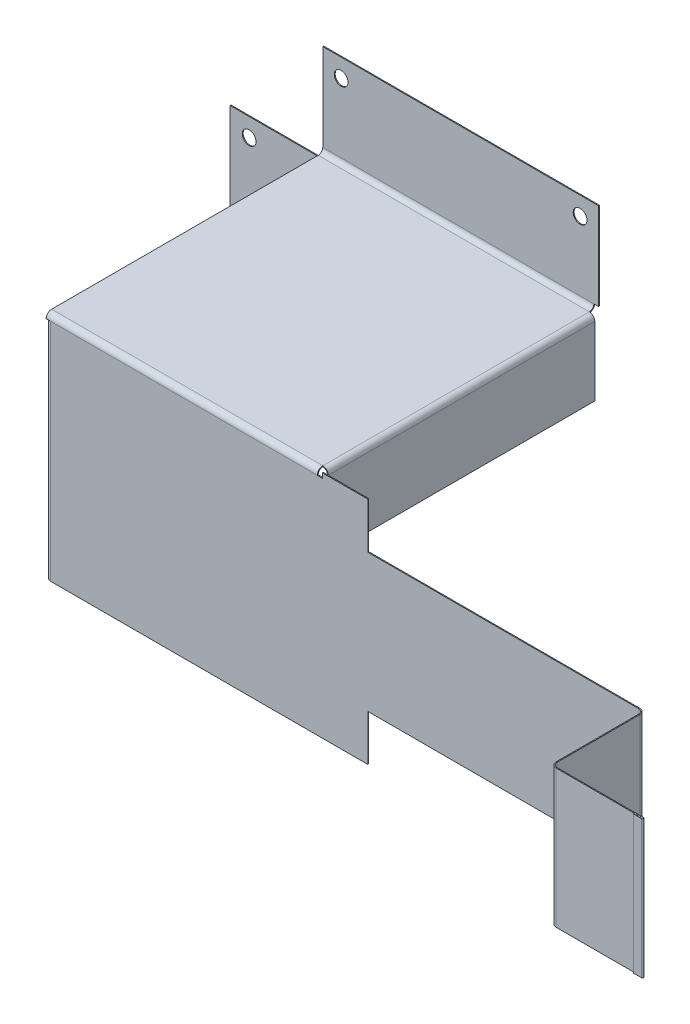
ISO-10303-21;
HEADER;
FILE_DESCRIPTION(('STEP AP214'),'2;1');
FILE_NAME('part.step','',(''),(''),'','','');
FILE_SCHEMA(('AUTOMOTIVE_DESIGN { 1 0 10303 214 1 1 1 1 }'));
ENDSEC;
DATA;
#1=APPLICATION_CONTEXT('core data for automotive mechanical design processes');
#2=APPLICATION_PROTOCOL_DEFINITION('international standard','automotive_design',2000,#1);
#3=PRODUCT_CONTEXT('',#1,'mechanical');
#4=PRODUCT('Part','Part','',(#3));
#5=PRODUCT_RELATED_PRODUCT_CATEGORY('part','',(#4));
#6=PRODUCT_DEFINITION_FORMATION('','',#4);
#7=PRODUCT_DEFINITION_CONTEXT('part definition',#1,'design');
#8=PRODUCT_DEFINITION('design','',#6,#7);
#9=PRODUCT_DEFINITION_SHAPE('','',#8);
#10=(LENGTH_UNIT() NAMED_UNIT(*) SI_UNIT(.MILLI.,.METRE.));
#11=(NAMED_UNIT(*) PLANE_ANGLE_UNIT() SI_UNIT($,.RADIAN.));
#12=(NAMED_UNIT(*) SI_UNIT($,.STERADIAN.) SOLID_ANGLE_UNIT());
#13=UNCERTAINTY_MEASURE_WITH_UNIT(LENGTH_MEASURE(1.E-05),#10,'distance_accuracy_value','');
#14=(GEOMETRIC_REPRESENTATION_CONTEXT(3) GLOBAL_UNCERTAINTY_ASSIGNED_CONTEXT((#13)) GLOBAL_UNIT_ASSIGNED_CONTEXT((#10,
#11,#12)) REPRESENTATION_CONTEXT('',''));
#15=CARTESIAN_POINT('',(0.,0.,0.));
#16=DIRECTION('',(0.,0.,1.));
#17=DIRECTION('',(1.,0.,0.));
#18=AXIS2_PLACEMENT_3D('',#15,#16,#17);
#19=CARTESIAN_POINT('',(295.,256.000000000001,-301.));
#20=DIRECTION('',(0.,1.,0.));
#21=DIRECTION('',(0.,0.,1.));
#22=AXIS2_PLACEMENT_3D('',#19,#20,#21);
#23=PLANE('',#22);
#24=DIRECTION('',(0.,0.,1.));
#25=VECTOR('',#24,1.);
#26=CARTESIAN_POINT('',(295.,256.000000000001,-301.));
#27=LINE('',#26,#25);
#28=CARTESIAN_POINT('',(295.,256.000000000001,-301.));
#29=VERTEX_POINT('',#28);
#30=CARTESIAN_POINT('',(295.,256.000000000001,-300.));
#31=VERTEX_POINT('',#30);
#32=EDGE_CURVE('E12',#29,#31,#27,.T.);
#33=ORIENTED_EDGE('',*,*,#32,.F.);
#34=DIRECTION('',(1.,0.,0.));
#35=VECTOR('',#34,1.);
#36=CARTESIAN_POINT('',(0.,256.000000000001,-301.));
#37=LINE('',#36,#35);
#38=CARTESIAN_POINT('',(300.,256.000000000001,-301.));
#39=VERTEX_POINT('',#38);
#40=EDGE_CURVE('E1663',#29,#39,#37,.T.);
#41=ORIENTED_EDGE('',*,*,#40,.T.);
#42=DIRECTION('',(0.,0.,-1.));
#43=VECTOR('',#42,1.);
#44=CARTESIAN_POINT('',(300.,256.000000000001,-300.));
#45=LINE('',#44,#43);
#46=CARTESIAN_POINT('',(300.,256.000000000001,-300.));
#47=VERTEX_POINT('',#46);
#48=EDGE_CURVE('E1656',#47,#39,#45,.T.);
#49=ORIENTED_EDGE('',*,*,#48,.F.);
#50=DIRECTION('',(-1.,0.,0.));
#51=VECTOR('',#50,1.);
#52=CARTESIAN_POINT('',(300.,256.000000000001,-300.));
#53=LINE('',#52,#51);
#54=EDGE_CURVE('E1657',#47,#31,#53,.T.);
#55=ORIENTED_EDGE('',*,*,#54,.T.);
#56=EDGE_LOOP('',(#33,#41,#49,#55));
#57=FACE_BOUND('',#56,.T.);
#58=ADVANCED_FACE('F39',(#57),#23,.F.);
#59=CARTESIAN_POINT('',(0.,256.000000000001,-295.));
#60=DIRECTION('',(-1.,0.,0.));
#61=DIRECTION('',(0.,0.,-1.));
#62=AXIS2_PLACEMENT_3D('',#59,#60,#61);
#63=CYLINDRICAL_SURFACE('',#62,6.);
#64=CARTESIAN_POINT('',(0.,256.000000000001,-301.));
#65=VERTEX_POINT('',#64);
#66=EDGE_CURVE('E1666',#65,#29,#37,.T.);
#67=ORIENTED_EDGE('',*,*,#66,.T.);
#68=CARTESIAN_POINT('',(295.,256.000000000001,-295.));
#69=DIRECTION('',(1.,0.,0.));
#70=DIRECTION('',(0.,1.,0.));
#71=AXIS2_PLACEMENT_3D('',#68,#69,#70);
#72=CIRCLE('',#71,6.);
#73=CARTESIAN_POINT('',(295.,250.000000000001,-295.));
#74=VERTEX_POINT('',#73);
#75=EDGE_CURVE('E572',#29,#74,#72,.F.);
#76=ORIENTED_EDGE('',*,*,#75,.T.);
#77=DIRECTION('',(-1.,0.,0.));
#78=VECTOR('',#77,1.);
#79=CARTESIAN_POINT('',(0.,250.000000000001,-295.));
#80=LINE('',#79,#78);
#81=CARTESIAN_POINT('',(0.,250.000000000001,-295.));
#82=VERTEX_POINT('',#81);
#83=EDGE_CURVE('E1700',#82,#74,#80,.F.);
#84=ORIENTED_EDGE('',*,*,#83,.F.);
#85=CARTESIAN_POINT('',(0.,256.000000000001,-295.));
#86=DIRECTION('',(-1.,0.,0.));
#87=DIRECTION('',(0.,0.,1.));
#88=AXIS2_PLACEMENT_3D('',#85,#86,#87);
#89=CIRCLE('',#88,6.);
#90=EDGE_CURVE('E593',#65,#82,#89,.T.);
#91=ORIENTED_EDGE('',*,*,#90,.F.);
#92=EDGE_LOOP('',(#67,#76,#84,#91));
#93=FACE_BOUND('',#92,.T.);
#94=ADVANCED_FACE('F629',(#93),#63,.T.);
#95=CARTESIAN_POINT('',(295.,245.,0.999999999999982));
#96=DIRECTION('',(0.,-1.,0.));
#97=DIRECTION('',(0.,0.,-1.));
#98=AXIS2_PLACEMENT_3D('',#95,#96,#97);
#99=PLANE('',#98);
#100=DIRECTION('',(0.,0.,-1.));
#101=VECTOR('',#100,1.);
#102=CARTESIAN_POINT('',(295.,245.,0.999999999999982));
#103=LINE('',#102,#101);
#104=CARTESIAN_POINT('',(295.,245.,0.999999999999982));
#105=VERTEX_POINT('',#104);
#106=CARTESIAN_POINT('',(295.,245.,0.));
#107=VERTEX_POINT('',#106);
#108=EDGE_CURVE('E570',#105,#107,#103,.T.);
#109=ORIENTED_EDGE('',*,*,#108,.F.);
#110=DIRECTION('',(1.,0.,0.));
#111=VECTOR('',#110,1.);
#112=CARTESIAN_POINT('',(300.,245.,0.999999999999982));
#113=LINE('',#112,#111);
#114=CARTESIAN_POINT('',(300.,245.,0.999999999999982));
#115=VERTEX_POINT('',#114);
#116=EDGE_CURVE('E1720',#115,#105,#113,.F.);
#117=ORIENTED_EDGE('',*,*,#116,.F.);
#118=DIRECTION('',(0.,0.,1.));
#119=VECTOR('',#118,1.);
#120=CARTESIAN_POINT('',(300.,245.,0.));
#121=LINE('',#120,#119);
#122=CARTESIAN_POINT('',(300.,245.,0.));
#123=VERTEX_POINT('',#122);
#124=EDGE_CURVE('E1727',#123,#115,#121,.T.);
#125=ORIENTED_EDGE('',*,*,#124,.F.);
#126=DIRECTION('',(1.,0.,0.));
#127=VECTOR('',#126,1.);
#128=CARTESIAN_POINT('',(300.,245.,0.));
#129=LINE('',#128,#127);
#130=EDGE_CURVE('E1730',#123,#107,#129,.F.);
#131=ORIENTED_EDGE('',*,*,#130,.T.);
#132=EDGE_LOOP('',(#109,#117,#125,#131));
#133=FACE_BOUND('',#132,.T.);
#134=ADVANCED_FACE('F633',(#133),#99,.F.);
#135=CARTESIAN_POINT('',(300.,245.,-4.99999999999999));
#136=DIRECTION('',(1.,0.,0.));
#137=DIRECTION('',(0.,1.,0.));
#138=AXIS2_PLACEMENT_3D('',#135,#136,#137);
#139=CYLINDRICAL_SURFACE('',#138,5.99999999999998);
#140=CARTESIAN_POINT('',(5.,245.,0.999999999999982));
#141=VERTEX_POINT('',#140);
#142=EDGE_CURVE('E1724',#105,#141,#113,.F.);
#143=ORIENTED_EDGE('',*,*,#142,.F.);
#144=CARTESIAN_POINT('',(295.,245.,-4.99999999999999));
#145=DIRECTION('',(1.,0.,0.));
#146=DIRECTION('',(0.,1.,0.));
#147=AXIS2_PLACEMENT_3D('',#144,#145,#146);
#148=CIRCLE('',#147,5.99999999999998);
#149=CARTESIAN_POINT('',(295.,251.,-5.0000000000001));
#150=VERTEX_POINT('',#149);
#151=EDGE_CURVE('E564',#105,#150,#148,.F.);
#152=ORIENTED_EDGE('',*,*,#151,.T.);
#153=DIRECTION('',(-1.,0.,0.));
#154=VECTOR('',#153,1.);
#155=CARTESIAN_POINT('',(0.,251.,-4.99999999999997));
#156=LINE('',#155,#154);
#157=CARTESIAN_POINT('',(0.,251.,-4.99999999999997));
#158=VERTEX_POINT('',#157);
#159=EDGE_CURVE('E586',#150,#158,#156,.T.);
#160=ORIENTED_EDGE('',*,*,#159,.T.);
#161=CARTESIAN_POINT('',(0.,245.,-4.99999999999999));
#162=DIRECTION('',(1.,0.,0.));
#163=DIRECTION('',(0.,0.,-1.));
#164=AXIS2_PLACEMENT_3D('',#161,#162,#163);
#165=CIRCLE('',#164,5.99999999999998);
#166=CARTESIAN_POINT('',(0.,245.,0.999999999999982));
#167=VERTEX_POINT('',#166);
#168=EDGE_CURVE('E1723',#167,#158,#165,.F.);
#169=ORIENTED_EDGE('',*,*,#168,.F.);
#170=DIRECTION('',(1.,0.,0.));
#171=VECTOR('',#170,1.);
#172=CARTESIAN_POINT('',(300.,244.999999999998,0.999999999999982));
#173=LINE('',#172,#171);
#174=EDGE_CURVE('E1621',#167,#141,#173,.T.);
#175=ORIENTED_EDGE('',*,*,#174,.T.);
#176=EDGE_LOOP('',(#143,#152,#160,#169,#175));
#177=FACE_BOUND('',#176,.T.);
#178=ADVANCED_FACE('F639',(#177),#139,.T.);
#179=CARTESIAN_POINT('',(0.,251.,0.));
#180=DIRECTION('',(0.,-1.,0.));
#181=DIRECTION('',(0.,0.,-1.));
#182=AXIS2_PLACEMENT_3D('',#179,#180,#181);
#183=PLANE('',#182);
#184=DIRECTION('',(0.,0.,1.));
#185=VECTOR('',#184,1.);
#186=CARTESIAN_POINT('',(295.,251.,-4.99999999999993));
#187=LINE('',#186,#185);
#188=CARTESIAN_POINT('',(295.,251.000000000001,-295.));
#189=VERTEX_POINT('',#188);
#190=EDGE_CURVE('E373',#150,#189,#187,.F.);
#191=ORIENTED_EDGE('',*,*,#190,.T.);
#192=DIRECTION('',(-1.,0.,0.));
#193=VECTOR('',#192,1.);
#194=CARTESIAN_POINT('',(0.,251.000000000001,-295.));
#195=LINE('',#194,#193);
#196=CARTESIAN_POINT('',(0.,251.000000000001,-295.));
#197=VERTEX_POINT('',#196);
#198=EDGE_CURVE('E584',#197,#189,#195,.F.);
#199=ORIENTED_EDGE('',*,*,#198,.F.);
#200=DIRECTION('',(0.,0.,1.));
#201=VECTOR('',#200,1.);
#202=CARTESIAN_POINT('',(0.,251.,0.));
#203=LINE('',#202,#201);
#204=EDGE_CURVE('E1716',#197,#158,#203,.T.);
#205=ORIENTED_EDGE('',*,*,#204,.T.);
#206=ORIENTED_EDGE('',*,*,#159,.F.);
#207=EDGE_LOOP('',(#191,#199,#205,#206));
#208=FACE_BOUND('',#207,.T.);
#209=ADVANCED_FACE('F582',(#208),#183,.F.);
#210=CARTESIAN_POINT('',(0.,250.,0.));
#211=DIRECTION('',(0.,-1.,0.));
#212=DIRECTION('',(0.,0.,-1.));
#213=AXIS2_PLACEMENT_3D('',#210,#211,#212);
#214=PLANE('',#213);
#215=ORIENTED_EDGE('',*,*,#83,.T.);
#216=DIRECTION('',(0.,0.,1.));
#217=VECTOR('',#216,1.);
#218=CARTESIAN_POINT('',(295.,250.,-4.99999999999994));
#219=LINE('',#218,#217);
#220=CARTESIAN_POINT('',(295.,250.,-5.0000000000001));
#221=VERTEX_POINT('',#220);
#222=EDGE_CURVE('E386',#221,#74,#219,.F.);
#223=ORIENTED_EDGE('',*,*,#222,.F.);
#224=DIRECTION('',(1.,0.,0.));
#225=VECTOR('',#224,1.);
#226=CARTESIAN_POINT('',(0.,250.,-4.99999999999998));
#227=LINE('',#226,#225);
#228=CARTESIAN_POINT('',(0.,250.,-4.99999999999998));
#229=VERTEX_POINT('',#228);
#230=EDGE_CURVE('E1709',#229,#221,#227,.T.);
#231=ORIENTED_EDGE('',*,*,#230,.F.);
#232=DIRECTION('',(0.,0.,1.));
#233=VECTOR('',#232,1.);
#234=CARTESIAN_POINT('',(0.,250.,0.));
#235=LINE('',#234,#233);
#236=EDGE_CURVE('E1715',#82,#229,#235,.T.);
#237=ORIENTED_EDGE('',*,*,#236,.F.);
#238=EDGE_LOOP('',(#215,#223,#231,#237));
#239=FACE_BOUND('',#238,.T.);
#240=ADVANCED_FACE('F657',(#239),#214,.T.);
#241=CARTESIAN_POINT('',(751.,200.,102.));
#242=DIRECTION('',(0.,1.,0.));
#243=DIRECTION('',(0.,0.,1.));
#244=AXIS2_PLACEMENT_3D('',#241,#242,#243);
#245=PLANE('',#244);
#246=DIRECTION('',(1.,0.,0.));
#247=VECTOR('',#246,1.);
#248=CARTESIAN_POINT('',(751.,200.,102.));
#249=LINE('',#248,#247);
#250=CARTESIAN_POINT('',(656.,200.,102.));
#251=VERTEX_POINT('',#250);
#252=CARTESIAN_POINT('',(749.95,200.,102.));
#253=VERTEX_POINT('',#252);
#254=EDGE_CURVE('E465',#251,#253,#249,.T.);
#255=ORIENTED_EDGE('',*,*,#254,.T.);
#256=DIRECTION('',(0.,0.,-1.));
#257=VECTOR('',#256,1.);
#258=CARTESIAN_POINT('',(749.95,200.,102.));
#259=LINE('',#258,#257);
#260=CARTESIAN_POINT('',(749.95,200.,101.));
#261=VERTEX_POINT('',#260);
#262=EDGE_CURVE('E404',#253,#261,#259,.T.);
#263=ORIENTED_EDGE('',*,*,#262,.T.);
#264=DIRECTION('',(1.,0.,0.));
#265=VECTOR('',#264,1.);
#266=CARTESIAN_POINT('',(751.,200.,101.));
#267=LINE('',#266,#265);
#268=CARTESIAN_POINT('',(656.,200.,101.));
#269=VERTEX_POINT('',#268);
#270=EDGE_CURVE('E464',#269,#261,#267,.T.);
#271=ORIENTED_EDGE('',*,*,#270,.F.);
#272=DIRECTION('',(0.,0.,1.));
#273=VECTOR('',#272,1.);
#274=CARTESIAN_POINT('',(656.,200.,101.));
#275=LINE('',#274,#273);
#276=EDGE_CURVE('E451',#269,#251,#275,.T.);
#277=ORIENTED_EDGE('',*,*,#276,.T.);
#278=EDGE_LOOP('',(#255,#263,#271,#277));
#279=FACE_BOUND('',#278,.T.);
#280=ADVANCED_FACE('F660',(#279),#245,.T.);
#281=CARTESIAN_POINT('',(651.,50.,101.));
#282=DIRECTION('',(0.,-1.,0.));
#283=DIRECTION('',(0.,0.,-1.));
#284=AXIS2_PLACEMENT_3D('',#281,#282,#283);
#285=PLANE('',#284);
#286=DIRECTION('',(0.,0.,1.));
#287=VECTOR('',#286,1.);
#288=CARTESIAN_POINT('',(651.,50.,101.));
#289=LINE('',#288,#287);
#290=CARTESIAN_POINT('',(651.,50.,6.));
#291=VERTEX_POINT('',#290);
#292=CARTESIAN_POINT('',(651.,50.,96.));
#293=VERTEX_POINT('',#292);
#294=EDGE_CURVE('E509',#291,#293,#289,.T.);
#295=ORIENTED_EDGE('',*,*,#294,.T.);
#296=DIRECTION('',(-1.,0.,0.));
#297=VECTOR('',#296,1.);
#298=CARTESIAN_POINT('',(651.,50.,96.));
#299=LINE('',#298,#297);
#300=CARTESIAN_POINT('',(650.,50.,96.));
#301=VERTEX_POINT('',#300);
#302=EDGE_CURVE('E481',#293,#301,#299,.T.);
#303=ORIENTED_EDGE('',*,*,#302,.T.);
#304=DIRECTION('',(0.,0.,1.));
#305=VECTOR('',#304,1.);
#306=CARTESIAN_POINT('',(650.,50.,101.));
#307=LINE('',#306,#305);
#308=CARTESIAN_POINT('',(650.,50.,6.00000000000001));
#309=VERTEX_POINT('',#308);
#310=EDGE_CURVE('E508',#309,#301,#307,.T.);
#311=ORIENTED_EDGE('',*,*,#310,.F.);
#312=DIRECTION('',(1.,0.,0.));
#313=VECTOR('',#312,1.);
#314=CARTESIAN_POINT('',(650.,50.,6.00000000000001));
#315=LINE('',#314,#313);
#316=EDGE_CURVE('E495',#309,#291,#315,.T.);
#317=ORIENTED_EDGE('',*,*,#316,.T.);
#318=EDGE_LOOP('',(#295,#303,#311,#317));
#319=FACE_BOUND('',#318,.T.);
#320=ADVANCED_FACE('F1253',(#319),#285,.T.);
#321=CARTESIAN_POINT('',(651.,200.,0.999999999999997));
#322=DIRECTION('',(1.,0.,0.));
#323=DIRECTION('',(0.,0.,-1.));
#324=AXIS2_PLACEMENT_3D('',#321,#322,#323);
#325=PLANE('',#324);
#326=DIRECTION('',(0.,0.,-1.));
#327=VECTOR('',#326,1.);
#328=CARTESIAN_POINT('',(651.,200.,0.999999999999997));
#329=LINE('',#328,#327);
#330=CARTESIAN_POINT('',(651.,200.,96.));
#331=VERTEX_POINT('',#330);
#332=CARTESIAN_POINT('',(651.,200.,6.));
#333=VERTEX_POINT('',#332);
#334=EDGE_CURVE('E512',#331,#333,#329,.T.);
#335=ORIENTED_EDGE('',*,*,#334,.F.);
#336=DIRECTION('',(0.,-1.,0.));
#337=VECTOR('',#336,1.);
#338=CARTESIAN_POINT('',(651.,50.,96.));
#339=LINE('',#338,#337);
#340=EDGE_CURVE('E487',#293,#331,#339,.F.);
#341=ORIENTED_EDGE('',*,*,#340,.F.);
#342=ORIENTED_EDGE('',*,*,#294,.F.);
#343=DIRECTION('',(0.,1.,0.));
#344=VECTOR('',#343,1.);
#345=CARTESIAN_POINT('',(651.,200.,6.));
#346=LINE('',#345,#344);
#347=EDGE_CURVE('E503',#291,#333,#346,.T.);
#348=ORIENTED_EDGE('',*,*,#347,.T.);
#349=EDGE_LOOP('',(#335,#341,#342,#348));
#350=FACE_BOUND('',#349,.T.);
#351=ADVANCED_FACE('F1291',(#350),#325,.T.);
#352=CARTESIAN_POINT('',(650.,200.,1.));
#353=DIRECTION('',(1.,0.,0.));
#354=DIRECTION('',(0.,0.,-1.));
#355=AXIS2_PLACEMENT_3D('',#352,#353,#354);
#356=PLANE('',#355);
#357=DIRECTION('',(0.,-1.,0.));
#358=VECTOR('',#357,1.);
#359=CARTESIAN_POINT('',(650.,50.,96.));
#360=LINE('',#359,#358);
#361=CARTESIAN_POINT('',(650.,200.,96.));
#362=VERTEX_POINT('',#361);
#363=EDGE_CURVE('E475',#301,#362,#360,.F.);
#364=ORIENTED_EDGE('',*,*,#363,.T.);
#365=DIRECTION('',(0.,0.,-1.));
#366=VECTOR('',#365,1.);
#367=CARTESIAN_POINT('',(650.,200.,1.));
#368=LINE('',#367,#366);
#369=CARTESIAN_POINT('',(650.,200.,6.00000000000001));
#370=VERTEX_POINT('',#369);
#371=EDGE_CURVE('E513',#362,#370,#368,.T.);
#372=ORIENTED_EDGE('',*,*,#371,.T.);
#373=DIRECTION('',(0.,1.,0.));
#374=VECTOR('',#373,1.);
#375=CARTESIAN_POINT('',(650.,50.,6.00000000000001));
#376=LINE('',#375,#374);
#377=EDGE_CURVE('E497',#309,#370,#376,.T.);
#378=ORIENTED_EDGE('',*,*,#377,.F.);
#379=ORIENTED_EDGE('',*,*,#310,.T.);
#380=EDGE_LOOP('',(#364,#372,#378,#379));
#381=FACE_BOUND('',#380,.T.);
#382=ADVANCED_FACE('F696',(#381),#356,.F.);
#383=CARTESIAN_POINT('',(0.,250.,1.));
#384=DIRECTION('',(0.,0.,-1.));
#385=DIRECTION('',(-1.,0.,0.));
#386=AXIS2_PLACEMENT_3D('',#383,#384,#385);
#387=PLANE('',#386);
#388=DIRECTION('',(0.,1.,0.));
#389=VECTOR('',#388,1.);
#390=CARTESIAN_POINT('',(645.,200.,1.00000000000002));
#391=LINE('',#390,#389);
#392=CARTESIAN_POINT('',(645.,200.,1.00000000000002));
#393=VERTEX_POINT('',#392);
#394=CARTESIAN_POINT('',(645.,50.,1.00000000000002));
#395=VERTEX_POINT('',#394);
#396=EDGE_CURVE('E532',#393,#395,#391,.F.);
#397=ORIENTED_EDGE('',*,*,#396,.F.);
#398=DIRECTION('',(-1.,0.,0.));
#399=VECTOR('',#398,1.);
#400=CARTESIAN_POINT('',(350.,200.,1.));
#401=LINE('',#400,#399);
#402=CARTESIAN_POINT('',(350.,200.,1.));
#403=VERTEX_POINT('',#402);
#404=EDGE_CURVE('E563',#393,#403,#401,.T.);
#405=ORIENTED_EDGE('',*,*,#404,.T.);
#406=DIRECTION('',(0.,1.,0.));
#407=VECTOR('',#406,1.);
#408=CARTESIAN_POINT('',(350.,0.,1.));
#409=LINE('',#408,#407);
#410=CARTESIAN_POINT('',(350.,250.,1.));
#411=VERTEX_POINT('',#410);
#412=EDGE_CURVE('E1762',#403,#411,#409,.T.);
#413=ORIENTED_EDGE('',*,*,#412,.T.);
#414=DIRECTION('',(-1.,0.,0.));
#415=VECTOR('',#414,1.);
#416=CARTESIAN_POINT('',(0.,250.,1.));
#417=LINE('',#416,#415);
#418=CARTESIAN_POINT('',(300.5,250.,1.));
#419=VERTEX_POINT('',#418);
#420=EDGE_CURVE('E1766',#411,#419,#417,.T.);
#421=ORIENTED_EDGE('',*,*,#420,.T.);
#422=DIRECTION('',(0.,1.,0.));
#423=VECTOR('',#422,1.);
#424=CARTESIAN_POINT('',(300.5,250.,1.));
#425=LINE('',#424,#423);
#426=CARTESIAN_POINT('',(300.5,244.5,1.));
#427=VERTEX_POINT('',#426);
#428=EDGE_CURVE('E1757',#427,#419,#425,.T.);
#429=ORIENTED_EDGE('',*,*,#428,.F.);
#430=DIRECTION('',(1.,0.,0.));
#431=VECTOR('',#430,1.);
#432=CARTESIAN_POINT('',(0.,244.5,1.));
#433=LINE('',#432,#431);
#434=CARTESIAN_POINT('',(300.,244.5,1.));
#435=VERTEX_POINT('',#434);
#436=EDGE_CURVE('E1755',#435,#427,#433,.T.);
#437=ORIENTED_EDGE('',*,*,#436,.F.);
#438=DIRECTION('',(0.,-1.,0.));
#439=VECTOR('',#438,1.);
#440=CARTESIAN_POINT('',(300.,250.,1.));
#441=LINE('',#440,#439);
#442=EDGE_CURVE('E1740',#115,#435,#441,.T.);
#443=ORIENTED_EDGE('',*,*,#442,.F.);
#444=ORIENTED_EDGE('',*,*,#116,.T.);
#445=ORIENTED_EDGE('',*,*,#142,.T.);
#446=DIRECTION('',(0.,1.,0.));
#447=VECTOR('',#446,1.);
#448=CARTESIAN_POINT('',(4.99999999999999,245.,0.99999999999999));
#449=LINE('',#448,#447);
#450=CARTESIAN_POINT('',(4.99999999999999,0.,1.));
#451=VERTEX_POINT('',#450);
#452=EDGE_CURVE('E1630',#141,#451,#449,.F.);
#453=ORIENTED_EDGE('',*,*,#452,.T.);
#454=DIRECTION('',(1.,0.,0.));
#455=VECTOR('',#454,1.);
#456=CARTESIAN_POINT('',(0.,0.,1.));
#457=LINE('',#456,#455);
#458=CARTESIAN_POINT('',(350.,0.,1.));
#459=VERTEX_POINT('',#458);
#460=EDGE_CURVE('E1760',#451,#459,#457,.T.);
#461=ORIENTED_EDGE('',*,*,#460,.T.);
#462=CARTESIAN_POINT('',(350.,50.,1.));
#463=VERTEX_POINT('',#462);
#464=EDGE_CURVE('E1772',#459,#463,#409,.T.);
#465=ORIENTED_EDGE('',*,*,#464,.T.);
#466=DIRECTION('',(1.,0.,0.));
#467=VECTOR('',#466,1.);
#468=CARTESIAN_POINT('',(350.,50.,1.));
#469=LINE('',#468,#467);
#470=EDGE_CURVE('E539',#463,#395,#469,.T.);
#471=ORIENTED_EDGE('',*,*,#470,.T.);
#472=EDGE_LOOP('',(#397,#405,#413,#421,#429,#437,#443,#444,#445,#453,#461,#465,#471));
#473=FACE_BOUND('',#472,.T.);
#474=ADVANCED_FACE('F692',(#473),#387,.F.);
#475=CARTESIAN_POINT('',(0.,250.,0.));
#476=DIRECTION('',(0.,0.,-1.));
#477=DIRECTION('',(-1.,0.,0.));
#478=AXIS2_PLACEMENT_3D('',#475,#476,#477);
#479=PLANE('',#478);
#480=DIRECTION('',(-1.,0.,0.));
#481=VECTOR('',#480,1.);
#482=CARTESIAN_POINT('',(350.,200.,0.));
#483=LINE('',#482,#481);
#484=CARTESIAN_POINT('',(645.,200.,0.));
#485=VERTEX_POINT('',#484);
#486=CARTESIAN_POINT('',(350.,200.,0.));
#487=VERTEX_POINT('',#486);
#488=EDGE_CURVE('E560',#485,#487,#483,.T.);
#489=ORIENTED_EDGE('',*,*,#488,.F.);
#490=DIRECTION('',(0.,1.,0.));
#491=VECTOR('',#490,1.);
#492=CARTESIAN_POINT('',(645.,200.,0.));
#493=LINE('',#492,#491);
#494=CARTESIAN_POINT('',(645.,50.,0.));
#495=VERTEX_POINT('',#494);
#496=EDGE_CURVE('E519',#485,#495,#493,.F.);
#497=ORIENTED_EDGE('',*,*,#496,.T.);
#498=DIRECTION('',(1.,0.,0.));
#499=VECTOR('',#498,1.);
#500=CARTESIAN_POINT('',(350.,50.,0.));
#501=LINE('',#500,#499);
#502=CARTESIAN_POINT('',(350.,50.,0.));
#503=VERTEX_POINT('',#502);
#504=EDGE_CURVE('E562',#503,#495,#501,.T.);
#505=ORIENTED_EDGE('',*,*,#504,.F.);
#506=DIRECTION('',(0.,1.,0.));
#507=VECTOR('',#506,1.);
#508=CARTESIAN_POINT('',(350.,0.,0.));
#509=LINE('',#508,#507);
#510=CARTESIAN_POINT('',(350.,0.,0.));
#511=VERTEX_POINT('',#510);
#512=EDGE_CURVE('E1778',#511,#503,#509,.T.);
#513=ORIENTED_EDGE('',*,*,#512,.F.);
#514=DIRECTION('',(1.,0.,0.));
#515=VECTOR('',#514,1.);
#516=CARTESIAN_POINT('',(0.,0.,0.));
#517=LINE('',#516,#515);
#518=CARTESIAN_POINT('',(4.99999999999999,0.,0.));
#519=VERTEX_POINT('',#518);
#520=EDGE_CURVE('E1759',#519,#511,#517,.T.);
#521=ORIENTED_EDGE('',*,*,#520,.F.);
#522=DIRECTION('',(0.,1.,0.));
#523=VECTOR('',#522,1.);
#524=CARTESIAN_POINT('',(4.99999999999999,245.,0.));
#525=LINE('',#524,#523);
#526=CARTESIAN_POINT('',(4.99999999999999,245.,0.));
#527=VERTEX_POINT('',#526);
#528=EDGE_CURVE('E1643',#527,#519,#525,.F.);
#529=ORIENTED_EDGE('',*,*,#528,.F.);
#530=EDGE_CURVE('E1718',#107,#527,#129,.F.);
#531=ORIENTED_EDGE('',*,*,#530,.F.);
#532=ORIENTED_EDGE('',*,*,#130,.F.);
#533=DIRECTION('',(0.,1.,0.));
#534=VECTOR('',#533,1.);
#535=CARTESIAN_POINT('',(300.,244.5,0.));
#536=LINE('',#535,#534);
#537=CARTESIAN_POINT('',(300.,244.5,0.));
#538=VERTEX_POINT('',#537);
#539=EDGE_CURVE('E1746',#538,#123,#536,.T.);
#540=ORIENTED_EDGE('',*,*,#539,.F.);
#541=DIRECTION('',(-1.,0.,0.));
#542=VECTOR('',#541,1.);
#543=CARTESIAN_POINT('',(300.5,244.5,0.));
#544=LINE('',#543,#542);
#545=CARTESIAN_POINT('',(300.5,244.5,0.));
#546=VERTEX_POINT('',#545);
#547=EDGE_CURVE('E1742',#546,#538,#544,.T.);
#548=ORIENTED_EDGE('',*,*,#547,.F.);
#549=DIRECTION('',(0.,-1.,0.));
#550=VECTOR('',#549,1.);
#551=CARTESIAN_POINT('',(300.5,250.,0.));
#552=LINE('',#551,#550);
#553=CARTESIAN_POINT('',(300.5,250.,0.));
#554=VERTEX_POINT('',#553);
#555=EDGE_CURVE('E1737',#554,#546,#552,.T.);
#556=ORIENTED_EDGE('',*,*,#555,.F.);
#557=DIRECTION('',(-1.,0.,0.));
#558=VECTOR('',#557,1.);
#559=CARTESIAN_POINT('',(0.,250.,0.));
#560=LINE('',#559,#558);
#561=CARTESIAN_POINT('',(350.,250.,0.));
#562=VERTEX_POINT('',#561);
#563=EDGE_CURVE('E1763',#562,#554,#560,.T.);
#564=ORIENTED_EDGE('',*,*,#563,.F.);
#565=EDGE_CURVE('E1775',#487,#562,#509,.T.);
#566=ORIENTED_EDGE('',*,*,#565,.F.);
#567=EDGE_LOOP('',(#489,#497,#505,#513,#521,#529,#531,#532,#540,#548,#556,#564,#566));
#568=FACE_BOUND('',#567,.T.);
#569=ADVANCED_FACE('F695',(#568),#479,.T.);
#570=CARTESIAN_POINT('',(350.,200.,0.));
#571=DIRECTION('',(0.,1.,0.));
#572=DIRECTION('',(0.,0.,1.));
#573=AXIS2_PLACEMENT_3D('',#570,#571,#572);
#574=PLANE('',#573);
#575=ORIENTED_EDGE('',*,*,#404,.F.);
#576=DIRECTION('',(0.,0.,-1.));
#577=VECTOR('',#576,1.);
#578=CARTESIAN_POINT('',(645.,200.,1.00000000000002));
#579=LINE('',#578,#577);
#580=EDGE_CURVE('E526',#393,#485,#579,.T.);
#581=ORIENTED_EDGE('',*,*,#580,.T.);
#582=ORIENTED_EDGE('',*,*,#488,.T.);
#583=DIRECTION('',(0.,0.,1.));
#584=VECTOR('',#583,1.);
#585=CARTESIAN_POINT('',(350.,200.,0.));
#586=LINE('',#585,#584);
#587=EDGE_CURVE('E547',#487,#403,#586,.T.);
#588=ORIENTED_EDGE('',*,*,#587,.T.);
#589=EDGE_LOOP('',(#575,#581,#582,#588));
#590=FACE_BOUND('',#589,.T.);
#591=ADVANCED_FACE('F700',(#590),#574,.T.);
#592=CARTESIAN_POINT('',(350.,0.,1.));
#593=DIRECTION('',(-1.,0.,0.));
#594=DIRECTION('',(0.,0.,1.));
#595=AXIS2_PLACEMENT_3D('',#592,#593,#594);
#596=PLANE('',#595);
#597=ORIENTED_EDGE('',*,*,#587,.F.);
#598=ORIENTED_EDGE('',*,*,#565,.T.);
#599=DIRECTION('',(0.,0.,-1.));
#600=VECTOR('',#599,1.);
#601=CARTESIAN_POINT('',(350.,250.,1.));
#602=LINE('',#601,#600);
#603=EDGE_CURVE('E1785',#411,#562,#602,.T.);
#604=ORIENTED_EDGE('',*,*,#603,.F.);
#605=ORIENTED_EDGE('',*,*,#412,.F.);
#606=EDGE_LOOP('',(#597,#598,#604,#605));
#607=FACE_BOUND('',#606,.T.);
#608=ADVANCED_FACE('F708',(#607),#596,.F.);
#609=CARTESIAN_POINT('',(-1.00000000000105,245.,-300.));
#610=DIRECTION('',(0.,-1.,0.));
#611=DIRECTION('',(0.,0.,-1.));
#612=AXIS2_PLACEMENT_3D('',#609,#610,#611);
#613=PLANE('',#612);
#614=DIRECTION('',(1.,0.,0.));
#615=VECTOR('',#614,1.);
#616=CARTESIAN_POINT('',(-1.00000000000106,245.,-295.));
#617=LINE('',#616,#615);
#618=CARTESIAN_POINT('',(-1.00000000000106,245.,-295.));
#619=VERTEX_POINT('',#618);
#620=CARTESIAN_POINT('',(-1.02998759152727E-12,245.,-295.));
#621=VERTEX_POINT('',#620);
#622=EDGE_CURVE('E1885',#619,#621,#617,.T.);
#623=ORIENTED_EDGE('',*,*,#622,.F.);
#624=DIRECTION('',(0.,0.,-1.));
#625=VECTOR('',#624,1.);
#626=CARTESIAN_POINT('',(-1.00000000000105,245.,-300.));
#627=LINE('',#626,#625);
#628=CARTESIAN_POINT('',(-1.00000000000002,245.,-5.));
#629=VERTEX_POINT('',#628);
#630=EDGE_CURVE('E1896',#629,#619,#627,.T.);
#631=ORIENTED_EDGE('',*,*,#630,.F.);
#632=DIRECTION('',(-1.,0.,0.));
#633=VECTOR('',#632,1.);
#634=CARTESIAN_POINT('',(0.,245.,-5.));
#635=LINE('',#634,#633);
#636=CARTESIAN_POINT('',(0.,245.,-5.));
#637=VERTEX_POINT('',#636);
#638=EDGE_CURVE('E1637',#637,#629,#635,.T.);
#639=ORIENTED_EDGE('',*,*,#638,.F.);
#640=DIRECTION('',(0.,0.,-1.));
#641=VECTOR('',#640,1.);
#642=CARTESIAN_POINT('',(-1.04744500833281E-12,245.,-300.));
#643=LINE('',#642,#641);
#644=EDGE_CURVE('E1895',#637,#621,#643,.T.);
#645=ORIENTED_EDGE('',*,*,#644,.T.);
#646=EDGE_LOOP('',(#623,#631,#639,#645));
#647=FACE_BOUND('',#646,.T.);
#648=ADVANCED_FACE('F1369',(#647),#613,.F.);
#649=CARTESIAN_POINT('',(-1.,0.,0.));
#650=DIRECTION('',(0.,1.,0.));
#651=DIRECTION('',(0.,0.,1.));
#652=AXIS2_PLACEMENT_3D('',#649,#650,#651);
#653=PLANE('',#652);
#654=DIRECTION('',(1.,0.,0.));
#655=VECTOR('',#654,1.);
#656=CARTESIAN_POINT('',(-1.00000000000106,0.,-295.));
#657=LINE('',#656,#655);
#658=CARTESIAN_POINT('',(-1.00000000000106,0.,-295.));
#659=VERTEX_POINT('',#658);
#660=CARTESIAN_POINT('',(-1.05557923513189E-12,0.,-295.));
#661=VERTEX_POINT('',#660);
#662=EDGE_CURVE('E1889',#659,#661,#657,.T.);
#663=ORIENTED_EDGE('',*,*,#662,.T.);
#664=DIRECTION('',(0.,0.,1.));
#665=VECTOR('',#664,1.);
#666=CARTESIAN_POINT('',(0.,0.,0.));
#667=LINE('',#666,#665);
#668=CARTESIAN_POINT('',(0.,0.,-4.99999999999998));
#669=VERTEX_POINT('',#668);
#670=EDGE_CURVE('E1899',#661,#669,#667,.T.);
#671=ORIENTED_EDGE('',*,*,#670,.T.);
#672=DIRECTION('',(-1.,0.,0.));
#673=VECTOR('',#672,1.);
#674=CARTESIAN_POINT('',(0.,0.,-4.99999999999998));
#675=LINE('',#674,#673);
#676=CARTESIAN_POINT('',(-1.00000000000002,0.,-4.99999999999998));
#677=VERTEX_POINT('',#676);
#678=EDGE_CURVE('E1882',#669,#677,#675,.T.);
#679=ORIENTED_EDGE('',*,*,#678,.T.);
#680=DIRECTION('',(0.,0.,1.));
#681=VECTOR('',#680,1.);
#682=CARTESIAN_POINT('',(-1.,0.,0.));
#683=LINE('',#682,#681);
#684=EDGE_CURVE('E1651',#659,#677,#683,.T.);
#685=ORIENTED_EDGE('',*,*,#684,.F.);
#686=EDGE_LOOP('',(#663,#671,#679,#685));
#687=FACE_BOUND('',#686,.T.);
#688=ADVANCED_FACE('F1421',(#687),#653,.F.);
#689=CARTESIAN_POINT('',(-1.,245.,0.));
#690=DIRECTION('',(1.,0.,0.));
#691=DIRECTION('',(0.,0.,-1.));
#692=AXIS2_PLACEMENT_3D('',#689,#690,#691);
#693=PLANE('',#692);
#694=DIRECTION('',(0.,-1.,0.));
#695=VECTOR('',#694,1.);
#696=CARTESIAN_POINT('',(-1.00000000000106,0.,-295.));
#697=LINE('',#696,#695);
#698=EDGE_CURVE('E1911',#659,#619,#697,.F.);
#699=ORIENTED_EDGE('',*,*,#698,.F.);
#700=ORIENTED_EDGE('',*,*,#684,.T.);
#701=DIRECTION('',(0.,-1.,0.));
#702=VECTOR('',#701,1.);
#703=CARTESIAN_POINT('',(-1.00000000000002,245.,-5.));
#704=LINE('',#703,#702);
#705=EDGE_CURVE('E1893',#629,#677,#704,.T.);
#706=ORIENTED_EDGE('',*,*,#705,.F.);
#707=ORIENTED_EDGE('',*,*,#630,.T.);
#708=EDGE_LOOP('',(#699,#700,#706,#707));
#709=FACE_BOUND('',#708,.T.);
#710=ADVANCED_FACE('F1432',(#709),#693,.F.);
#711=CARTESIAN_POINT('',(0.,245.,0.));
#712=DIRECTION('',(1.,0.,0.));
#713=DIRECTION('',(0.,0.,-1.));
#714=AXIS2_PLACEMENT_3D('',#711,#712,#713);
#715=PLANE('',#714);
#716=ORIENTED_EDGE('',*,*,#670,.F.);
#717=DIRECTION('',(0.,-1.,0.));
#718=VECTOR('',#717,1.);
#719=CARTESIAN_POINT('',(-1.05557923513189E-12,0.,-295.));
#720=LINE('',#719,#718);
#721=EDGE_CURVE('E1907',#661,#621,#720,.F.);
#722=ORIENTED_EDGE('',*,*,#721,.T.);
#723=ORIENTED_EDGE('',*,*,#644,.F.);
#724=DIRECTION('',(0.,1.,0.));
#725=VECTOR('',#724,1.);
#726=CARTESIAN_POINT('',(0.,0.,-4.99999999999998));
#727=LINE('',#726,#725);
#728=EDGE_CURVE('E1884',#669,#637,#727,.T.);
#729=ORIENTED_EDGE('',*,*,#728,.F.);
#730=EDGE_LOOP('',(#716,#722,#723,#729));
#731=FACE_BOUND('',#730,.T.);
#732=ADVANCED_FACE('F1443',(#731),#715,.T.);
#733=CARTESIAN_POINT('',(0.,245.,0.));
#734=DIRECTION('',(0.,-1.,0.));
#735=DIRECTION('',(1.,0.,0.));
#736=AXIS2_PLACEMENT_3D('',#733,#734,#735);
#737=PLANE('',#736);
#738=DIRECTION('',(1.,0.,0.));
#739=VECTOR('',#738,1.);
#740=CARTESIAN_POINT('',(0.,245.,0.));
#741=LINE('',#740,#739);
#742=CARTESIAN_POINT('',(0.,245.,0.));
#743=VERTEX_POINT('',#742);
#744=CARTESIAN_POINT('',(1.68337520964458,245.,0.));
#745=VERTEX_POINT('',#744);
#746=EDGE_CURVE('E1614',#743,#745,#741,.T.);
#747=ORIENTED_EDGE('',*,*,#746,.T.);
#748=CARTESIAN_POINT('',(4.99999999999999,245.,-5.00000000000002));
#749=DIRECTION('',(0.,1.,0.));
#750=DIRECTION('',(0.,0.,1.));
#751=AXIS2_PLACEMENT_3D('',#748,#749,#750);
#752=CIRCLE('',#751,6.00000000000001);
#753=EDGE_CURVE('E568',#745,#141,#752,.T.);
#754=ORIENTED_EDGE('',*,*,#753,.T.);
#755=ORIENTED_EDGE('',*,*,#174,.F.);
#756=DIRECTION('',(0.,0.,1.));
#757=VECTOR('',#756,1.);
#758=CARTESIAN_POINT('',(0.,245.,0.));
#759=LINE('',#758,#757);
#760=EDGE_CURVE('E1618',#743,#167,#759,.T.);
#761=ORIENTED_EDGE('',*,*,#760,.F.);
#762=EDGE_LOOP('',(#747,#754,#755,#761));
#763=FACE_BOUND('',#762,.T.);
#764=ADVANCED_FACE('F711',(#763),#737,.T.);
#765=CARTESIAN_POINT('',(0.,0.,1.));
#766=DIRECTION('',(0.,1.,0.));
#767=DIRECTION('',(0.,0.,1.));
#768=AXIS2_PLACEMENT_3D('',#765,#766,#767);
#769=PLANE('',#768);
#770=DIRECTION('',(0.,0.,1.));
#771=VECTOR('',#770,1.);
#772=CARTESIAN_POINT('',(4.99999999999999,0.,0.));
#773=LINE('',#772,#771);
#774=EDGE_CURVE('E1652',#519,#451,#773,.T.);
#775=ORIENTED_EDGE('',*,*,#774,.F.);
#776=ORIENTED_EDGE('',*,*,#520,.T.);
#777=DIRECTION('',(0.,0.,-1.));
#778=VECTOR('',#777,1.);
#779=CARTESIAN_POINT('',(350.,0.,1.));
#780=LINE('',#779,#778);
#781=EDGE_CURVE('E1631',#459,#511,#780,.T.);
#782=ORIENTED_EDGE('',*,*,#781,.F.);
#783=ORIENTED_EDGE('',*,*,#460,.F.);
#784=EDGE_LOOP('',(#775,#776,#782,#783));
#785=FACE_BOUND('',#784,.T.);
#786=ADVANCED_FACE('F666',(#785),#769,.F.);
#787=CARTESIAN_POINT('',(0.,251.,0.));
#788=DIRECTION('',(1.,0.,0.));
#789=DIRECTION('',(0.,0.,-1.));
#790=AXIS2_PLACEMENT_3D('',#787,#788,#789);
#791=PLANE('',#790);
#792=DIRECTION('',(0.,-1.,0.));
#793=VECTOR('',#792,1.);
#794=CARTESIAN_POINT('',(0.,251.000000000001,-295.));
#795=LINE('',#794,#793);
#796=EDGE_CURVE('E1702',#197,#82,#795,.T.);
#797=ORIENTED_EDGE('',*,*,#796,.T.);
#798=ORIENTED_EDGE('',*,*,#236,.T.);
#799=DIRECTION('',(0.,1.,0.));
#800=VECTOR('',#799,1.);
#801=CARTESIAN_POINT('',(0.,250.,-4.99999999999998));
#802=LINE('',#801,#800);
#803=EDGE_CURVE('E1708',#229,#158,#802,.T.);
#804=ORIENTED_EDGE('',*,*,#803,.T.);
#805=ORIENTED_EDGE('',*,*,#204,.F.);
#806=EDGE_LOOP('',(#797,#798,#804,#805));
#807=FACE_BOUND('',#806,.T.);
#808=ADVANCED_FACE('F662',(#807),#791,.F.);
#809=CARTESIAN_POINT('',(0.,250.,1.));
#810=DIRECTION('',(0.,-1.,0.));
#811=DIRECTION('',(0.,0.,-1.));
#812=AXIS2_PLACEMENT_3D('',#809,#810,#811);
#813=PLANE('',#812);
#814=DIRECTION('',(0.,0.,1.));
#815=VECTOR('',#814,1.);
#816=CARTESIAN_POINT('',(300.5,250.,0.));
#817=LINE('',#816,#815);
#818=EDGE_CURVE('E1741',#554,#419,#817,.T.);
#819=ORIENTED_EDGE('',*,*,#818,.T.);
#820=ORIENTED_EDGE('',*,*,#420,.F.);
#821=ORIENTED_EDGE('',*,*,#603,.T.);
#822=ORIENTED_EDGE('',*,*,#563,.T.);
#823=EDGE_LOOP('',(#819,#820,#821,#822));
#824=FACE_BOUND('',#823,.T.);
#825=ADVANCED_FACE('F665',(#824),#813,.F.);
#826=ORIENTED_EDGE('',*,*,#512,.T.);
#827=DIRECTION('',(0.,0.,1.));
#828=VECTOR('',#827,1.);
#829=CARTESIAN_POINT('',(350.,50.,0.));
#830=LINE('',#829,#828);
#831=EDGE_CURVE('E552',#503,#463,#830,.T.);
#832=ORIENTED_EDGE('',*,*,#831,.T.);
#833=ORIENTED_EDGE('',*,*,#464,.F.);
#834=ORIENTED_EDGE('',*,*,#781,.T.);
#835=EDGE_LOOP('',(#826,#832,#833,#834));
#836=FACE_BOUND('',#835,.T.);
#837=ADVANCED_FACE('F690',(#836),#596,.F.);
#838=CARTESIAN_POINT('',(300.5,250.,0.));
#839=DIRECTION('',(-1.,0.,0.));
#840=DIRECTION('',(0.,0.,1.));
#841=AXIS2_PLACEMENT_3D('',#838,#839,#840);
#842=PLANE('',#841);
#843=DIRECTION('',(0.,0.,1.));
#844=VECTOR('',#843,1.);
#845=CARTESIAN_POINT('',(300.5,244.5,0.));
#846=LINE('',#845,#844);
#847=EDGE_CURVE('E1745',#546,#427,#846,.T.);
#848=ORIENTED_EDGE('',*,*,#847,.T.);
#849=ORIENTED_EDGE('',*,*,#428,.T.);
#850=ORIENTED_EDGE('',*,*,#818,.F.);
#851=ORIENTED_EDGE('',*,*,#555,.T.);
#852=EDGE_LOOP('',(#848,#849,#850,#851));
#853=FACE_BOUND('',#852,.T.);
#854=ADVANCED_FACE('F686',(#853),#842,.T.);
#855=CARTESIAN_POINT('',(300.5,244.5,0.));
#856=DIRECTION('',(0.,1.,0.));
#857=DIRECTION('',(0.,0.,1.));
#858=AXIS2_PLACEMENT_3D('',#855,#856,#857);
#859=PLANE('',#858);
#860=DIRECTION('',(0.,0.,1.));
#861=VECTOR('',#860,1.);
#862=CARTESIAN_POINT('',(300.,244.5,0.));
#863=LINE('',#862,#861);
#864=EDGE_CURVE('E1734',#538,#435,#863,.T.);
#865=ORIENTED_EDGE('',*,*,#864,.T.);
#866=ORIENTED_EDGE('',*,*,#436,.T.);
#867=ORIENTED_EDGE('',*,*,#847,.F.);
#868=ORIENTED_EDGE('',*,*,#547,.T.);
#869=EDGE_LOOP('',(#865,#866,#867,#868));
#870=FACE_BOUND('',#869,.T.);
#871=ADVANCED_FACE('F682',(#870),#859,.T.);
#872=CARTESIAN_POINT('',(300.,244.5,0.));
#873=DIRECTION('',(1.,0.,0.));
#874=DIRECTION('',(0.,0.,-1.));
#875=AXIS2_PLACEMENT_3D('',#872,#873,#874);
#876=PLANE('',#875);
#877=ORIENTED_EDGE('',*,*,#124,.T.);
#878=ORIENTED_EDGE('',*,*,#442,.T.);
#879=ORIENTED_EDGE('',*,*,#864,.F.);
#880=ORIENTED_EDGE('',*,*,#539,.T.);
#881=EDGE_LOOP('',(#877,#878,#879,#880));
#882=FACE_BOUND('',#881,.T.);
#883=ADVANCED_FACE('F678',(#882),#876,.T.);
#884=CARTESIAN_POINT('',(0.,245.,-4.99999999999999));
#885=DIRECTION('',(-1.,0.,0.));
#886=DIRECTION('',(0.,0.,1.));
#887=AXIS2_PLACEMENT_3D('',#884,#885,#886);
#888=PLANE('',#887);
#889=ORIENTED_EDGE('',*,*,#803,.F.);
#890=CARTESIAN_POINT('',(0.,245.,-4.99999999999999));
#891=DIRECTION('',(1.,0.,0.));
#892=DIRECTION('',(0.,0.,-1.));
#893=AXIS2_PLACEMENT_3D('',#890,#891,#892);
#894=CIRCLE('',#893,4.99999999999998);
#895=EDGE_CURVE('E1728',#743,#229,#894,.F.);
#896=ORIENTED_EDGE('',*,*,#895,.F.);
#897=ORIENTED_EDGE('',*,*,#760,.T.);
#898=ORIENTED_EDGE('',*,*,#168,.T.);
#899=EDGE_LOOP('',(#889,#896,#897,#898));
#900=FACE_BOUND('',#899,.T.);
#901=ADVANCED_FACE('F675',(#900),#888,.T.);
#902=CARTESIAN_POINT('',(295.,245.,-4.99999999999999));
#903=DIRECTION('',(1.,0.,0.));
#904=DIRECTION('',(0.,1.,0.));
#905=AXIS2_PLACEMENT_3D('',#902,#903,#904);
#906=PLANE('',#905);
#907=ORIENTED_EDGE('',*,*,#151,.F.);
#908=ORIENTED_EDGE('',*,*,#108,.T.);
#909=CARTESIAN_POINT('',(295.,245.,-4.99999999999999));
#910=DIRECTION('',(1.,0.,0.));
#911=DIRECTION('',(0.,1.,0.));
#912=AXIS2_PLACEMENT_3D('',#909,#910,#911);
#913=CIRCLE('',#912,4.99999999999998);
#914=EDGE_CURVE('E567',#107,#221,#913,.F.);
#915=ORIENTED_EDGE('',*,*,#914,.T.);
#916=DIRECTION('',(0.,1.,0.));
#917=VECTOR('',#916,1.);
#918=CARTESIAN_POINT('',(295.,250.,-5.0000000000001));
#919=LINE('',#918,#917);
#920=EDGE_CURVE('E380',#221,#150,#919,.T.);
#921=ORIENTED_EDGE('',*,*,#920,.T.);
#922=EDGE_LOOP('',(#907,#908,#915,#921));
#923=FACE_BOUND('',#922,.T.);
#924=ADVANCED_FACE('F673',(#923),#906,.T.);
#925=CARTESIAN_POINT('',(300.,245.,-4.99999999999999));
#926=DIRECTION('',(1.,0.,0.));
#927=DIRECTION('',(0.,1.,0.));
#928=AXIS2_PLACEMENT_3D('',#925,#926,#927);
#929=CYLINDRICAL_SURFACE('',#928,4.99999999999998);
#930=ORIENTED_EDGE('',*,*,#914,.F.);
#931=ORIENTED_EDGE('',*,*,#530,.T.);
#932=EDGE_CURVE('E1622',#745,#527,#741,.T.);
#933=ORIENTED_EDGE('',*,*,#932,.F.);
#934=ORIENTED_EDGE('',*,*,#746,.F.);
#935=ORIENTED_EDGE('',*,*,#895,.T.);
#936=ORIENTED_EDGE('',*,*,#230,.T.);
#937=EDGE_LOOP('',(#930,#931,#933,#934,#935,#936));
#938=FACE_BOUND('',#937,.T.);
#939=ADVANCED_FACE('F653',(#938),#929,.F.);
#940=CARTESIAN_POINT('',(0.,256.000000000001,-295.));
#941=DIRECTION('',(1.,0.,0.));
#942=DIRECTION('',(0.,0.,-1.));
#943=AXIS2_PLACEMENT_3D('',#940,#941,#942);
#944=PLANE('',#943);
#945=CARTESIAN_POINT('',(0.,256.000000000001,-295.));
#946=DIRECTION('',(-1.,0.,0.));
#947=DIRECTION('',(0.,0.,1.));
#948=AXIS2_PLACEMENT_3D('',#945,#946,#947);
#949=CIRCLE('',#948,5.);
#950=CARTESIAN_POINT('',(0.,256.000000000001,-300.));
#951=VERTEX_POINT('',#950);
#952=EDGE_CURVE('E592',#951,#197,#949,.T.);
#953=ORIENTED_EDGE('',*,*,#952,.F.);
#954=DIRECTION('',(0.,0.,-1.));
#955=VECTOR('',#954,1.);
#956=CARTESIAN_POINT('',(0.,256.000000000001,-300.));
#957=LINE('',#956,#955);
#958=EDGE_CURVE('E1659',#951,#65,#957,.T.);
#959=ORIENTED_EDGE('',*,*,#958,.T.);
#960=ORIENTED_EDGE('',*,*,#90,.T.);
#961=ORIENTED_EDGE('',*,*,#796,.F.);
#962=EDGE_LOOP('',(#953,#959,#960,#961));
#963=FACE_BOUND('',#962,.T.);
#964=ADVANCED_FACE('F650',(#963),#944,.F.);
#965=CARTESIAN_POINT('',(295.,256.000000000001,-295.));
#966=DIRECTION('',(1.,0.,0.));
#967=DIRECTION('',(0.,1.,0.));
#968=AXIS2_PLACEMENT_3D('',#965,#966,#967);
#969=PLANE('',#968);
#970=ORIENTED_EDGE('',*,*,#75,.F.);
#971=ORIENTED_EDGE('',*,*,#32,.T.);
#972=CARTESIAN_POINT('',(295.,256.000000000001,-295.));
#973=DIRECTION('',(1.,0.,0.));
#974=DIRECTION('',(0.,1.,0.));
#975=AXIS2_PLACEMENT_3D('',#972,#973,#974);
#976=CIRCLE('',#975,5.);
#977=EDGE_CURVE('E46',#31,#189,#976,.F.);
#978=ORIENTED_EDGE('',*,*,#977,.T.);
#979=DIRECTION('',(0.,1.,0.));
#980=VECTOR('',#979,1.);
#981=CARTESIAN_POINT('',(295.,250.000000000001,-295.));
#982=LINE('',#981,#980);
#983=EDGE_CURVE('E391',#74,#189,#982,.T.);
#984=ORIENTED_EDGE('',*,*,#983,.F.);
#985=EDGE_LOOP('',(#970,#971,#978,#984));
#986=FACE_BOUND('',#985,.T.);
#987=ADVANCED_FACE('F574',(#986),#969,.T.);
#988=CARTESIAN_POINT('',(0.,256.000000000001,-295.));
#989=DIRECTION('',(-1.,0.,0.));
#990=DIRECTION('',(0.,0.,-1.));
#991=AXIS2_PLACEMENT_3D('',#988,#989,#990);
#992=CYLINDRICAL_SURFACE('',#991,5.);
#993=ORIENTED_EDGE('',*,*,#977,.F.);
#994=EDGE_CURVE('E1660',#31,#951,#53,.T.);
#995=ORIENTED_EDGE('',*,*,#994,.T.);
#996=ORIENTED_EDGE('',*,*,#952,.T.);
#997=ORIENTED_EDGE('',*,*,#198,.T.);
#998=EDGE_LOOP('',(#993,#995,#996,#997));
#999=FACE_BOUND('',#998,.T.);
#1000=ADVANCED_FACE('F590',(#999),#992,.F.);
#1001=CARTESIAN_POINT('',(0.,251.000000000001,-301.));
#1002=DIRECTION('',(0.,0.,1.));
#1003=DIRECTION('',(1.,0.,0.));
#1004=AXIS2_PLACEMENT_3D('',#1001,#1002,#1003);
#1005=PLANE('',#1004);
#1006=CARTESIAN_POINT('',(280.,331.000000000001,-301.));
#1007=DIRECTION('',(0.,0.,-1.));
#1008=DIRECTION('',(0.,1.,0.));
#1009=AXIS2_PLACEMENT_3D('',#1006,#1007,#1008);
#1010=CIRCLE('',#1009,7.50000000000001);
#1011=CARTESIAN_POINT('',(280.,338.500000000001,-301.));
#1012=VERTEX_POINT('',#1011);
#1013=EDGE_CURVE('E1669',#1012,#1012,#1010,.T.);
#1014=ORIENTED_EDGE('',*,*,#1013,.F.);
#1015=EDGE_LOOP('',(#1014));
#1016=FACE_BOUND('',#1015,.T.);
#1017=CARTESIAN_POINT('',(20.,331.000000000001,-301.));
#1018=DIRECTION('',(0.,0.,-1.));
#1019=DIRECTION('',(0.,1.,0.));
#1020=AXIS2_PLACEMENT_3D('',#1017,#1018,#1019);
#1021=CIRCLE('',#1020,7.5);
#1022=CARTESIAN_POINT('',(20.,338.500000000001,-301.));
#1023=VERTEX_POINT('',#1022);
#1024=EDGE_CURVE('E1675',#1023,#1023,#1021,.T.);
#1025=ORIENTED_EDGE('',*,*,#1024,.F.);
#1026=EDGE_LOOP('',(#1025));
#1027=FACE_BOUND('',#1026,.T.);
#1028=ORIENTED_EDGE('',*,*,#66,.F.);
#1029=DIRECTION('',(0.,1.,0.));
#1030=VECTOR('',#1029,1.);
#1031=CARTESIAN_POINT('',(0.,351.000000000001,-301.));
#1032=LINE('',#1031,#1030);
#1033=CARTESIAN_POINT('',(0.,351.000000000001,-301.));
#1034=VERTEX_POINT('',#1033);
#1035=EDGE_CURVE('E1681',#65,#1034,#1032,.T.);
#1036=ORIENTED_EDGE('',*,*,#1035,.T.);
#1037=DIRECTION('',(1.,0.,0.));
#1038=VECTOR('',#1037,1.);
#1039=CARTESIAN_POINT('',(300.,351.000000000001,-301.));
#1040=LINE('',#1039,#1038);
#1041=CARTESIAN_POINT('',(300.,351.000000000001,-301.));
#1042=VERTEX_POINT('',#1041);
#1043=EDGE_CURVE('E1683',#1034,#1042,#1040,.T.);
#1044=ORIENTED_EDGE('',*,*,#1043,.T.);
#1045=DIRECTION('',(0.,-1.,0.));
#1046=VECTOR('',#1045,1.);
#1047=CARTESIAN_POINT('',(300.,251.000000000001,-301.));
#1048=LINE('',#1047,#1046);
#1049=EDGE_CURVE('E1686',#1042,#39,#1048,.T.);
#1050=ORIENTED_EDGE('',*,*,#1049,.T.);
#1051=ORIENTED_EDGE('',*,*,#40,.F.);
#1052=EDGE_LOOP('',(#1028,#1036,#1044,#1050,#1051));
#1053=FACE_BOUND('',#1052,.T.);
#1054=ADVANCED_FACE('F649',(#1016,#1027,#1053),#1005,.F.);
#1055=CARTESIAN_POINT('',(0.,251.000000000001,-300.));
#1056=DIRECTION('',(0.,0.,1.));
#1057=DIRECTION('',(1.,0.,0.));
#1058=AXIS2_PLACEMENT_3D('',#1055,#1056,#1057);
#1059=PLANE('',#1058);
#1060=CARTESIAN_POINT('',(280.,331.000000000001,-300.));
#1061=DIRECTION('',(0.,0.,-1.));
#1062=DIRECTION('',(0.,1.,0.));
#1063=AXIS2_PLACEMENT_3D('',#1060,#1061,#1062);
#1064=CIRCLE('',#1063,7.50000000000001);
#1065=CARTESIAN_POINT('',(280.,338.500000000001,-300.));
#1066=VERTEX_POINT('',#1065);
#1067=EDGE_CURVE('E1668',#1066,#1066,#1064,.T.);
#1068=ORIENTED_EDGE('',*,*,#1067,.T.);
#1069=EDGE_LOOP('',(#1068));
#1070=FACE_BOUND('',#1069,.T.);
#1071=CARTESIAN_POINT('',(20.,331.000000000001,-300.));
#1072=DIRECTION('',(0.,0.,-1.));
#1073=DIRECTION('',(0.,1.,0.));
#1074=AXIS2_PLACEMENT_3D('',#1071,#1072,#1073);
#1075=CIRCLE('',#1074,7.5);
#1076=CARTESIAN_POINT('',(20.,338.500000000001,-300.));
#1077=VERTEX_POINT('',#1076);
#1078=EDGE_CURVE('E1672',#1077,#1077,#1075,.T.);
#1079=ORIENTED_EDGE('',*,*,#1078,.T.);
#1080=EDGE_LOOP('',(#1079));
#1081=FACE_BOUND('',#1080,.T.);
#1082=DIRECTION('',(0.,1.,0.));
#1083=VECTOR('',#1082,1.);
#1084=CARTESIAN_POINT('',(0.,351.000000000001,-300.));
#1085=LINE('',#1084,#1083);
#1086=CARTESIAN_POINT('',(0.,351.000000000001,-300.));
#1087=VERTEX_POINT('',#1086);
#1088=EDGE_CURVE('E1678',#951,#1087,#1085,.T.);
#1089=ORIENTED_EDGE('',*,*,#1088,.F.);
#1090=ORIENTED_EDGE('',*,*,#994,.F.);
#1091=ORIENTED_EDGE('',*,*,#54,.F.);
#1092=DIRECTION('',(0.,-1.,0.));
#1093=VECTOR('',#1092,1.);
#1094=CARTESIAN_POINT('',(300.,251.000000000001,-300.));
#1095=LINE('',#1094,#1093);
#1096=CARTESIAN_POINT('',(300.,351.000000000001,-300.));
#1097=VERTEX_POINT('',#1096);
#1098=EDGE_CURVE('E1684',#1097,#47,#1095,.T.);
#1099=ORIENTED_EDGE('',*,*,#1098,.F.);
#1100=DIRECTION('',(1.,0.,0.));
#1101=VECTOR('',#1100,1.);
#1102=CARTESIAN_POINT('',(300.,351.000000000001,-300.));
#1103=LINE('',#1102,#1101);
#1104=EDGE_CURVE('E1691',#1087,#1097,#1103,.T.);
#1105=ORIENTED_EDGE('',*,*,#1104,.F.);
#1106=EDGE_LOOP('',(#1089,#1090,#1091,#1099,#1105));
#1107=FACE_BOUND('',#1106,.T.);
#1108=ADVANCED_FACE('F731',(#1070,#1081,#1107),#1059,.T.);
#1109=CARTESIAN_POINT('',(0.,351.000000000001,-301.));
#1110=DIRECTION('',(1.,0.,0.));
#1111=DIRECTION('',(0.,0.,-1.));
#1112=AXIS2_PLACEMENT_3D('',#1109,#1110,#1111);
#1113=PLANE('',#1112);
#1114=ORIENTED_EDGE('',*,*,#958,.F.);
#1115=ORIENTED_EDGE('',*,*,#1088,.T.);
#1116=DIRECTION('',(0.,0.,1.));
#1117=VECTOR('',#1116,1.);
#1118=CARTESIAN_POINT('',(0.,351.000000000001,-301.));
#1119=LINE('',#1118,#1117);
#1120=EDGE_CURVE('E1697',#1034,#1087,#1119,.T.);
#1121=ORIENTED_EDGE('',*,*,#1120,.F.);
#1122=ORIENTED_EDGE('',*,*,#1035,.F.);
#1123=EDGE_LOOP('',(#1114,#1115,#1121,#1122));
#1124=FACE_BOUND('',#1123,.T.);
#1125=ADVANCED_FACE('F645',(#1124),#1113,.F.);
#1126=CARTESIAN_POINT('',(300.,251.000000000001,-301.));
#1127=DIRECTION('',(-1.,0.,0.));
#1128=DIRECTION('',(0.,0.,1.));
#1129=AXIS2_PLACEMENT_3D('',#1126,#1127,#1128);
#1130=PLANE('',#1129);
#1131=ORIENTED_EDGE('',*,*,#48,.T.);
#1132=ORIENTED_EDGE('',*,*,#1049,.F.);
#1133=DIRECTION('',(0.,0.,1.));
#1134=VECTOR('',#1133,1.);
#1135=CARTESIAN_POINT('',(300.,351.000000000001,-301.));
#1136=LINE('',#1135,#1134);
#1137=EDGE_CURVE('E1689',#1042,#1097,#1136,.T.);
#1138=ORIENTED_EDGE('',*,*,#1137,.T.);
#1139=ORIENTED_EDGE('',*,*,#1098,.T.);
#1140=EDGE_LOOP('',(#1131,#1132,#1138,#1139));
#1141=FACE_BOUND('',#1140,.T.);
#1142=ADVANCED_FACE('F747',(#1141),#1130,.F.);
#1143=CARTESIAN_POINT('',(300.,351.000000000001,-301.));
#1144=DIRECTION('',(0.,-1.,0.));
#1145=DIRECTION('',(0.,0.,-1.));
#1146=AXIS2_PLACEMENT_3D('',#1143,#1144,#1145);
#1147=PLANE('',#1146);
#1148=ORIENTED_EDGE('',*,*,#1104,.T.);
#1149=ORIENTED_EDGE('',*,*,#1137,.F.);
#1150=ORIENTED_EDGE('',*,*,#1043,.F.);
#1151=ORIENTED_EDGE('',*,*,#1120,.T.);
#1152=EDGE_LOOP('',(#1148,#1149,#1150,#1151));
#1153=FACE_BOUND('',#1152,.T.);
#1154=ADVANCED_FACE('F754',(#1153),#1147,.F.);
#1155=CARTESIAN_POINT('',(20.,331.000000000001,-301.));
#1156=DIRECTION('',(0.,0.,1.));
#1157=DIRECTION('',(0.,-1.,0.));
#1158=AXIS2_PLACEMENT_3D('',#1155,#1156,#1157);
#1159=CYLINDRICAL_SURFACE('',#1158,7.5);
#1160=ORIENTED_EDGE('',*,*,#1024,.T.);
#1161=EDGE_LOOP('',(#1160));
#1162=FACE_BOUND('',#1161,.T.);
#1163=ORIENTED_EDGE('',*,*,#1078,.F.);
#1164=EDGE_LOOP('',(#1163));
#1165=FACE_BOUND('',#1164,.T.);
#1166=ADVANCED_FACE('F762',(#1162,#1165),#1159,.F.);
#1167=CARTESIAN_POINT('',(280.,331.000000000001,-301.));
#1168=DIRECTION('',(0.,0.,1.));
#1169=DIRECTION('',(0.,-1.,0.));
#1170=AXIS2_PLACEMENT_3D('',#1167,#1168,#1169);
#1171=CYLINDRICAL_SURFACE('',#1170,7.50000000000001);
#1172=ORIENTED_EDGE('',*,*,#1013,.T.);
#1173=EDGE_LOOP('',(#1172));
#1174=FACE_BOUND('',#1173,.T.);
#1175=ORIENTED_EDGE('',*,*,#1067,.F.);
#1176=EDGE_LOOP('',(#1175));
#1177=FACE_BOUND('',#1176,.T.);
#1178=ADVANCED_FACE('F769',(#1174,#1177),#1171,.F.);
#1179=CARTESIAN_POINT('',(4.99999999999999,0.,-5.));
#1180=DIRECTION('',(0.,-1.,0.));
#1181=DIRECTION('',(0.,0.,-1.));
#1182=AXIS2_PLACEMENT_3D('',#1179,#1180,#1181);
#1183=PLANE('',#1182);
#1184=ORIENTED_EDGE('',*,*,#678,.F.);
#1185=CARTESIAN_POINT('',(4.99999999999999,0.,-5.));
#1186=DIRECTION('',(0.,1.,0.));
#1187=DIRECTION('',(0.,0.,1.));
#1188=AXIS2_PLACEMENT_3D('',#1185,#1186,#1187);
#1189=CIRCLE('',#1188,5.00000000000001);
#1190=EDGE_CURVE('E1639',#519,#669,#1189,.F.);
#1191=ORIENTED_EDGE('',*,*,#1190,.F.);
#1192=ORIENTED_EDGE('',*,*,#774,.T.);
#1193=CARTESIAN_POINT('',(4.99999999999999,0.,-5.));
#1194=DIRECTION('',(0.,1.,0.));
#1195=DIRECTION('',(0.,0.,1.));
#1196=AXIS2_PLACEMENT_3D('',#1193,#1194,#1195);
#1197=CIRCLE('',#1196,6.00000000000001);
#1198=EDGE_CURVE('E1640',#451,#677,#1197,.F.);
#1199=ORIENTED_EDGE('',*,*,#1198,.T.);
#1200=EDGE_LOOP('',(#1184,#1191,#1192,#1199));
#1201=FACE_BOUND('',#1200,.T.);
#1202=ADVANCED_FACE('F777',(#1201),#1183,.T.);
#1203=CARTESIAN_POINT('',(4.99999999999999,245.,-5.00000000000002));
#1204=DIRECTION('',(0.,-1.,0.));
#1205=DIRECTION('',(0.,0.,-1.));
#1206=AXIS2_PLACEMENT_3D('',#1203,#1204,#1205);
#1207=PLANE('',#1206);
#1208=EDGE_CURVE('E1627',#629,#745,#752,.T.);
#1209=ORIENTED_EDGE('',*,*,#1208,.T.);
#1210=ORIENTED_EDGE('',*,*,#932,.T.);
#1211=CARTESIAN_POINT('',(4.99999999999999,245.,-5.00000000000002));
#1212=DIRECTION('',(0.,1.,0.));
#1213=DIRECTION('',(0.,0.,1.));
#1214=AXIS2_PLACEMENT_3D('',#1211,#1212,#1213);
#1215=CIRCLE('',#1214,5.00000000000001);
#1216=EDGE_CURVE('E1649',#637,#527,#1215,.T.);
#1217=ORIENTED_EDGE('',*,*,#1216,.F.);
#1218=ORIENTED_EDGE('',*,*,#638,.T.);
#1219=EDGE_LOOP('',(#1209,#1210,#1217,#1218));
#1220=FACE_BOUND('',#1219,.T.);
#1221=ADVANCED_FACE('F786',(#1220),#1207,.F.);
#1222=CARTESIAN_POINT('',(4.99999999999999,245.,-5.00000000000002));
#1223=DIRECTION('',(0.,1.,0.));
#1224=DIRECTION('',(-1.,0.,0.));
#1225=AXIS2_PLACEMENT_3D('',#1222,#1223,#1224);
#1226=CYLINDRICAL_SURFACE('',#1225,6.00000000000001);
#1227=ORIENTED_EDGE('',*,*,#452,.F.);
#1228=ORIENTED_EDGE('',*,*,#753,.F.);
#1229=ORIENTED_EDGE('',*,*,#1208,.F.);
#1230=ORIENTED_EDGE('',*,*,#705,.T.);
#1231=ORIENTED_EDGE('',*,*,#1198,.F.);
#1232=EDGE_LOOP('',(#1227,#1228,#1229,#1230,#1231));
#1233=FACE_BOUND('',#1232,.T.);
#1234=ADVANCED_FACE('F789',(#1233),#1226,.T.);
#1235=CARTESIAN_POINT('',(4.99999999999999,245.,-5.00000000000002));
#1236=DIRECTION('',(0.,1.,0.));
#1237=DIRECTION('',(-1.,0.,0.));
#1238=AXIS2_PLACEMENT_3D('',#1235,#1236,#1237);
#1239=CYLINDRICAL_SURFACE('',#1238,5.00000000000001);
#1240=ORIENTED_EDGE('',*,*,#528,.T.);
#1241=ORIENTED_EDGE('',*,*,#1190,.T.);
#1242=ORIENTED_EDGE('',*,*,#728,.T.);
#1243=ORIENTED_EDGE('',*,*,#1216,.T.);
#1244=EDGE_LOOP('',(#1240,#1241,#1242,#1243));
#1245=FACE_BOUND('',#1244,.T.);
#1246=ADVANCED_FACE('F798',(#1245),#1239,.F.);
#1247=CARTESIAN_POINT('',(-6.00000000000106,245.,-295.));
#1248=DIRECTION('',(0.,1.,0.));
#1249=DIRECTION('',(0.,0.,1.));
#1250=AXIS2_PLACEMENT_3D('',#1247,#1248,#1249);
#1251=PLANE('',#1250);
#1252=DIRECTION('',(0.,0.,-1.));
#1253=VECTOR('',#1252,1.);
#1254=CARTESIAN_POINT('',(-6.00000000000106,245.,-300.));
#1255=LINE('',#1254,#1253);
#1256=CARTESIAN_POINT('',(-6.00000000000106,245.,-300.));
#1257=VERTEX_POINT('',#1256);
#1258=CARTESIAN_POINT('',(-6.00000000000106,245.,-301.));
#1259=VERTEX_POINT('',#1258);
#1260=EDGE_CURVE('E551',#1257,#1259,#1255,.T.);
#1261=ORIENTED_EDGE('',*,*,#1260,.F.);
#1262=CARTESIAN_POINT('',(-6.00000000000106,245.,-295.));
#1263=DIRECTION('',(0.,-1.,0.));
#1264=DIRECTION('',(0.,0.,-1.));
#1265=AXIS2_PLACEMENT_3D('',#1262,#1263,#1264);
#1266=CIRCLE('',#1265,5.);
#1267=EDGE_CURVE('E1915',#619,#1257,#1266,.F.);
#1268=ORIENTED_EDGE('',*,*,#1267,.F.);
#1269=ORIENTED_EDGE('',*,*,#622,.T.);
#1270=CARTESIAN_POINT('',(-6.00000000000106,245.,-295.));
#1271=DIRECTION('',(0.,-1.,0.));
#1272=DIRECTION('',(0.,0.,-1.));
#1273=AXIS2_PLACEMENT_3D('',#1270,#1271,#1272);
#1274=CIRCLE('',#1273,6.);
#1275=EDGE_CURVE('E1924',#621,#1259,#1274,.F.);
#1276=ORIENTED_EDGE('',*,*,#1275,.T.);
#1277=EDGE_LOOP('',(#1261,#1268,#1269,#1276));
#1278=FACE_BOUND('',#1277,.T.);
#1279=ADVANCED_FACE('F811',(#1278),#1251,.T.);
#1280=CARTESIAN_POINT('',(-6.00000000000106,0.,-295.));
#1281=DIRECTION('',(0.,1.,0.));
#1282=DIRECTION('',(0.,0.,1.));
#1283=AXIS2_PLACEMENT_3D('',#1280,#1281,#1282);
#1284=PLANE('',#1283);
#1285=CARTESIAN_POINT('',(-6.00000000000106,0.,-295.));
#1286=DIRECTION('',(0.,-1.,0.));
#1287=DIRECTION('',(0.,0.,-1.));
#1288=AXIS2_PLACEMENT_3D('',#1285,#1286,#1287);
#1289=CIRCLE('',#1288,5.);
#1290=CARTESIAN_POINT('',(-6.00000000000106,0.,-300.));
#1291=VERTEX_POINT('',#1290);
#1292=EDGE_CURVE('E1916',#1291,#659,#1289,.T.);
#1293=ORIENTED_EDGE('',*,*,#1292,.F.);
#1294=DIRECTION('',(0.,0.,-1.));
#1295=VECTOR('',#1294,1.);
#1296=CARTESIAN_POINT('',(-6.00000000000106,0.,-300.));
#1297=LINE('',#1296,#1295);
#1298=CARTESIAN_POINT('',(-6.00000000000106,0.,-301.));
#1299=VERTEX_POINT('',#1298);
#1300=EDGE_CURVE('E1934',#1291,#1299,#1297,.T.);
#1301=ORIENTED_EDGE('',*,*,#1300,.T.);
#1302=CARTESIAN_POINT('',(-6.00000000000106,0.,-295.));
#1303=DIRECTION('',(0.,-1.,0.));
#1304=DIRECTION('',(0.,0.,-1.));
#1305=AXIS2_PLACEMENT_3D('',#1302,#1303,#1304);
#1306=CIRCLE('',#1305,6.);
#1307=EDGE_CURVE('E1918',#1299,#661,#1306,.T.);
#1308=ORIENTED_EDGE('',*,*,#1307,.T.);
#1309=ORIENTED_EDGE('',*,*,#662,.F.);
#1310=EDGE_LOOP('',(#1293,#1301,#1308,#1309));
#1311=FACE_BOUND('',#1310,.T.);
#1312=ADVANCED_FACE('F820',(#1311),#1284,.F.);
#1313=CARTESIAN_POINT('',(-6.00000000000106,0.,-295.));
#1314=DIRECTION('',(0.,-1.,0.));
#1315=DIRECTION('',(0.,0.,-1.));
#1316=AXIS2_PLACEMENT_3D('',#1313,#1314,#1315);
#1317=CYLINDRICAL_SURFACE('',#1316,6.);
#1318=ORIENTED_EDGE('',*,*,#721,.F.);
#1319=ORIENTED_EDGE('',*,*,#1307,.F.);
#1320=DIRECTION('',(0.,1.,0.));
#1321=VECTOR('',#1320,1.);
#1322=CARTESIAN_POINT('',(-6.00000000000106,0.,-301.));
#1323=LINE('',#1322,#1321);
#1324=EDGE_CURVE('E1936',#1299,#1259,#1323,.T.);
#1325=ORIENTED_EDGE('',*,*,#1324,.T.);
#1326=ORIENTED_EDGE('',*,*,#1275,.F.);
#1327=EDGE_LOOP('',(#1318,#1319,#1325,#1326));
#1328=FACE_BOUND('',#1327,.T.);
#1329=ADVANCED_FACE('F823',(#1328),#1317,.T.);
#1330=CARTESIAN_POINT('',(-6.00000000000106,0.,-295.));
#1331=DIRECTION('',(0.,-1.,0.));
#1332=DIRECTION('',(0.,0.,-1.));
#1333=AXIS2_PLACEMENT_3D('',#1330,#1331,#1332);
#1334=CYLINDRICAL_SURFACE('',#1333,5.);
#1335=ORIENTED_EDGE('',*,*,#698,.T.);
#1336=ORIENTED_EDGE('',*,*,#1267,.T.);
#1337=DIRECTION('',(0.,-1.,0.));
#1338=VECTOR('',#1337,1.);
#1339=CARTESIAN_POINT('',(-6.00000000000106,245.,-300.));
#1340=LINE('',#1339,#1338);
#1341=EDGE_CURVE('E1939',#1257,#1291,#1340,.T.);
#1342=ORIENTED_EDGE('',*,*,#1341,.T.);
#1343=ORIENTED_EDGE('',*,*,#1292,.T.);
#1344=EDGE_LOOP('',(#1335,#1336,#1342,#1343));
#1345=FACE_BOUND('',#1344,.T.);
#1346=ADVANCED_FACE('F832',(#1345),#1334,.F.);
#1347=CARTESIAN_POINT('',(-1.00000000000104,0.,-301.));
#1348=DIRECTION('',(0.,0.,1.));
#1349=DIRECTION('',(1.,0.,0.));
#1350=AXIS2_PLACEMENT_3D('',#1347,#1348,#1349);
#1351=PLANE('',#1350);
#1352=CARTESIAN_POINT('',(-80.0979974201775,225.,-301.));
#1353=DIRECTION('',(0.,0.,-1.));
#1354=DIRECTION('',(-1.,0.,0.));
#1355=AXIS2_PLACEMENT_3D('',#1352,#1353,#1354);
#1356=CIRCLE('',#1355,7.50000000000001);
#1357=CARTESIAN_POINT('',(-87.5979974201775,225.,-301.));
#1358=VERTEX_POINT('',#1357);
#1359=EDGE_CURVE('E1959',#1358,#1358,#1356,.T.);
#1360=ORIENTED_EDGE('',*,*,#1359,.F.);
#1361=EDGE_LOOP('',(#1360));
#1362=FACE_BOUND('',#1361,.T.);
#1363=CARTESIAN_POINT('',(-81.000000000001,25.,-301.));
#1364=DIRECTION('',(0.,0.,-1.));
#1365=DIRECTION('',(-1.,0.,0.));
#1366=AXIS2_PLACEMENT_3D('',#1363,#1364,#1365);
#1367=CIRCLE('',#1366,7.5);
#1368=CARTESIAN_POINT('',(-88.5000000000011,25.,-301.));
#1369=VERTEX_POINT('',#1368);
#1370=EDGE_CURVE('E1965',#1369,#1369,#1367,.T.);
#1371=ORIENTED_EDGE('',*,*,#1370,.F.);
#1372=EDGE_LOOP('',(#1371));
#1373=FACE_BOUND('',#1372,.T.);
#1374=ORIENTED_EDGE('',*,*,#1324,.F.);
#1375=DIRECTION('',(-1.,0.,0.));
#1376=VECTOR('',#1375,1.);
#1377=CARTESIAN_POINT('',(-101.000000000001,0.,-301.));
#1378=LINE('',#1377,#1376);
#1379=CARTESIAN_POINT('',(-101.000000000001,0.,-301.));
#1380=VERTEX_POINT('',#1379);
#1381=EDGE_CURVE('E1949',#1299,#1380,#1378,.T.);
#1382=ORIENTED_EDGE('',*,*,#1381,.T.);
#1383=DIRECTION('',(0.,1.,0.));
#1384=VECTOR('',#1383,1.);
#1385=CARTESIAN_POINT('',(-101.000000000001,245.,-301.));
#1386=LINE('',#1385,#1384);
#1387=CARTESIAN_POINT('',(-101.000000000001,245.,-301.));
#1388=VERTEX_POINT('',#1387);
#1389=EDGE_CURVE('E1971',#1380,#1388,#1386,.T.);
#1390=ORIENTED_EDGE('',*,*,#1389,.T.);
#1391=DIRECTION('',(1.,0.,0.));
#1392=VECTOR('',#1391,1.);
#1393=CARTESIAN_POINT('',(-1.00000000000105,245.,-301.));
#1394=LINE('',#1393,#1392);
#1395=EDGE_CURVE('E1973',#1388,#1259,#1394,.T.);
#1396=ORIENTED_EDGE('',*,*,#1395,.T.);
#1397=EDGE_LOOP('',(#1374,#1382,#1390,#1396));
#1398=FACE_BOUND('',#1397,.T.);
#1399=ADVANCED_FACE('F845',(#1362,#1373,#1398),#1351,.F.);
#1400=CARTESIAN_POINT('',(-1.00000000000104,0.,-300.));
#1401=DIRECTION('',(0.,0.,1.));
#1402=DIRECTION('',(1.,0.,0.));
#1403=AXIS2_PLACEMENT_3D('',#1400,#1401,#1402);
#1404=PLANE('',#1403);
#1405=CARTESIAN_POINT('',(-80.0979974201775,225.,-300.));
#1406=DIRECTION('',(0.,0.,-1.));
#1407=DIRECTION('',(-1.,0.,0.));
#1408=AXIS2_PLACEMENT_3D('',#1405,#1406,#1407);
#1409=CIRCLE('',#1408,7.50000000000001);
#1410=CARTESIAN_POINT('',(-87.5979974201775,225.,-300.));
#1411=VERTEX_POINT('',#1410);
#1412=EDGE_CURVE('E1958',#1411,#1411,#1409,.T.);
#1413=ORIENTED_EDGE('',*,*,#1412,.T.);
#1414=EDGE_LOOP('',(#1413));
#1415=FACE_BOUND('',#1414,.T.);
#1416=CARTESIAN_POINT('',(-81.000000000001,25.,-300.));
#1417=DIRECTION('',(0.,0.,-1.));
#1418=DIRECTION('',(-1.,0.,0.));
#1419=AXIS2_PLACEMENT_3D('',#1416,#1417,#1418);
#1420=CIRCLE('',#1419,7.5);
#1421=CARTESIAN_POINT('',(-88.5000000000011,25.,-300.));
#1422=VERTEX_POINT('',#1421);
#1423=EDGE_CURVE('E1962',#1422,#1422,#1420,.T.);
#1424=ORIENTED_EDGE('',*,*,#1423,.T.);
#1425=EDGE_LOOP('',(#1424));
#1426=FACE_BOUND('',#1425,.T.);
#1427=DIRECTION('',(-1.,0.,0.));
#1428=VECTOR('',#1427,1.);
#1429=CARTESIAN_POINT('',(-101.000000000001,0.,-300.));
#1430=LINE('',#1429,#1428);
#1431=CARTESIAN_POINT('',(-101.000000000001,0.,-300.));
#1432=VERTEX_POINT('',#1431);
#1433=EDGE_CURVE('E1953',#1291,#1432,#1430,.T.);
#1434=ORIENTED_EDGE('',*,*,#1433,.F.);
#1435=ORIENTED_EDGE('',*,*,#1341,.F.);
#1436=DIRECTION('',(1.,0.,0.));
#1437=VECTOR('',#1436,1.);
#1438=CARTESIAN_POINT('',(-1.00000000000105,245.,-300.));
#1439=LINE('',#1438,#1437);
#1440=CARTESIAN_POINT('',(-101.000000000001,245.,-300.));
#1441=VERTEX_POINT('',#1440);
#1442=EDGE_CURVE('E1942',#1441,#1257,#1439,.T.);
#1443=ORIENTED_EDGE('',*,*,#1442,.F.);
#1444=DIRECTION('',(0.,1.,0.));
#1445=VECTOR('',#1444,1.);
#1446=CARTESIAN_POINT('',(-101.000000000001,245.,-300.));
#1447=LINE('',#1446,#1445);
#1448=EDGE_CURVE('E1950',#1432,#1441,#1447,.T.);
#1449=ORIENTED_EDGE('',*,*,#1448,.F.);
#1450=EDGE_LOOP('',(#1434,#1435,#1443,#1449));
#1451=FACE_BOUND('',#1450,.T.);
#1452=ADVANCED_FACE('F853',(#1415,#1426,#1451),#1404,.T.);
#1453=CARTESIAN_POINT('',(-101.000000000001,0.,-301.));
#1454=DIRECTION('',(0.,1.,0.));
#1455=DIRECTION('',(0.,0.,1.));
#1456=AXIS2_PLACEMENT_3D('',#1453,#1454,#1455);
#1457=PLANE('',#1456);
#1458=ORIENTED_EDGE('',*,*,#1300,.F.);
#1459=ORIENTED_EDGE('',*,*,#1433,.T.);
#1460=DIRECTION('',(0.,0.,1.));
#1461=VECTOR('',#1460,1.);
#1462=CARTESIAN_POINT('',(-101.000000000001,0.,-301.));
#1463=LINE('',#1462,#1461);
#1464=EDGE_CURVE('E1920',#1380,#1432,#1463,.T.);
#1465=ORIENTED_EDGE('',*,*,#1464,.F.);
#1466=ORIENTED_EDGE('',*,*,#1381,.F.);
#1467=EDGE_LOOP('',(#1458,#1459,#1465,#1466));
#1468=FACE_BOUND('',#1467,.T.);
#1469=ADVANCED_FACE('F861',(#1468),#1457,.F.);
#1470=CARTESIAN_POINT('',(-1.00000000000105,245.,-301.));
#1471=DIRECTION('',(0.,-1.,0.));
#1472=DIRECTION('',(0.,0.,-1.));
#1473=AXIS2_PLACEMENT_3D('',#1470,#1471,#1472);
#1474=PLANE('',#1473);
#1475=ORIENTED_EDGE('',*,*,#1260,.T.);
#1476=ORIENTED_EDGE('',*,*,#1395,.F.);
#1477=DIRECTION('',(0.,0.,1.));
#1478=VECTOR('',#1477,1.);
#1479=CARTESIAN_POINT('',(-101.000000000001,245.,-301.));
#1480=LINE('',#1479,#1478);
#1481=EDGE_CURVE('E1946',#1388,#1441,#1480,.T.);
#1482=ORIENTED_EDGE('',*,*,#1481,.T.);
#1483=ORIENTED_EDGE('',*,*,#1442,.T.);
#1484=EDGE_LOOP('',(#1475,#1476,#1482,#1483));
#1485=FACE_BOUND('',#1484,.T.);
#1486=ADVANCED_FACE('F869',(#1485),#1474,.F.);
#1487=CARTESIAN_POINT('',(-101.000000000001,245.,-301.));
#1488=DIRECTION('',(1.,0.,0.));
#1489=DIRECTION('',(0.,0.,-1.));
#1490=AXIS2_PLACEMENT_3D('',#1487,#1488,#1489);
#1491=PLANE('',#1490);
#1492=ORIENTED_EDGE('',*,*,#1448,.T.);
#1493=ORIENTED_EDGE('',*,*,#1481,.F.);
#1494=ORIENTED_EDGE('',*,*,#1389,.F.);
#1495=ORIENTED_EDGE('',*,*,#1464,.T.);
#1496=EDGE_LOOP('',(#1492,#1493,#1494,#1495));
#1497=FACE_BOUND('',#1496,.T.);
#1498=ADVANCED_FACE('F877',(#1497),#1491,.F.);
#1499=CARTESIAN_POINT('',(-81.000000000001,25.,-301.));
#1500=DIRECTION('',(0.,0.,1.));
#1501=DIRECTION('',(1.,0.,0.));
#1502=AXIS2_PLACEMENT_3D('',#1499,#1500,#1501);
#1503=CYLINDRICAL_SURFACE('',#1502,7.5);
#1504=ORIENTED_EDGE('',*,*,#1370,.T.);
#1505=EDGE_LOOP('',(#1504));
#1506=FACE_BOUND('',#1505,.T.);
#1507=ORIENTED_EDGE('',*,*,#1423,.F.);
#1508=EDGE_LOOP('',(#1507));
#1509=FACE_BOUND('',#1508,.T.);
#1510=ADVANCED_FACE('F885',(#1506,#1509),#1503,.F.);
#1511=CARTESIAN_POINT('',(-80.0979974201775,225.,-301.));
#1512=DIRECTION('',(0.,0.,1.));
#1513=DIRECTION('',(1.,0.,0.));
#1514=AXIS2_PLACEMENT_3D('',#1511,#1512,#1513);
#1515=CYLINDRICAL_SURFACE('',#1514,7.50000000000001);
#1516=ORIENTED_EDGE('',*,*,#1359,.T.);
#1517=EDGE_LOOP('',(#1516));
#1518=FACE_BOUND('',#1517,.T.);
#1519=ORIENTED_EDGE('',*,*,#1412,.F.);
#1520=EDGE_LOOP('',(#1519));
#1521=FACE_BOUND('',#1520,.T.);
#1522=ADVANCED_FACE('F893',(#1518,#1521),#1515,.F.);
#1523=CARTESIAN_POINT('',(350.,50.,0.));
#1524=DIRECTION('',(0.,-1.,0.));
#1525=DIRECTION('',(1.,0.,0.));
#1526=AXIS2_PLACEMENT_3D('',#1523,#1524,#1525);
#1527=PLANE('',#1526);
#1528=DIRECTION('',(0.,0.,-1.));
#1529=VECTOR('',#1528,1.);
#1530=CARTESIAN_POINT('',(645.,50.,1.00000000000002));
#1531=LINE('',#1530,#1529);
#1532=EDGE_CURVE('E536',#395,#495,#1531,.T.);
#1533=ORIENTED_EDGE('',*,*,#1532,.F.);
#1534=ORIENTED_EDGE('',*,*,#470,.F.);
#1535=ORIENTED_EDGE('',*,*,#831,.F.);
#1536=ORIENTED_EDGE('',*,*,#504,.T.);
#1537=EDGE_LOOP('',(#1533,#1534,#1535,#1536));
#1538=FACE_BOUND('',#1537,.T.);
#1539=ADVANCED_FACE('F901',(#1538),#1527,.T.);
#1540=CARTESIAN_POINT('',(645.,50.,6.00000000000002));
#1541=DIRECTION('',(0.,-1.,0.));
#1542=DIRECTION('',(0.,0.,-1.));
#1543=AXIS2_PLACEMENT_3D('',#1540,#1541,#1542);
#1544=PLANE('',#1543);
#1545=ORIENTED_EDGE('',*,*,#316,.F.);
#1546=CARTESIAN_POINT('',(645.,50.,6.00000000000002));
#1547=DIRECTION('',(0.,1.,0.));
#1548=DIRECTION('',(0.,0.,1.));
#1549=AXIS2_PLACEMENT_3D('',#1546,#1547,#1548);
#1550=CIRCLE('',#1549,5.);
#1551=EDGE_CURVE('E529',#395,#309,#1550,.F.);
#1552=ORIENTED_EDGE('',*,*,#1551,.F.);
#1553=ORIENTED_EDGE('',*,*,#1532,.T.);
#1554=CARTESIAN_POINT('',(645.,50.,6.00000000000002));
#1555=DIRECTION('',(0.,1.,0.));
#1556=DIRECTION('',(0.,0.,1.));
#1557=AXIS2_PLACEMENT_3D('',#1554,#1555,#1556);
#1558=CIRCLE('',#1557,6.);
#1559=EDGE_CURVE('E522',#495,#291,#1558,.F.);
#1560=ORIENTED_EDGE('',*,*,#1559,.T.);
#1561=EDGE_LOOP('',(#1545,#1552,#1553,#1560));
#1562=FACE_BOUND('',#1561,.T.);
#1563=ADVANCED_FACE('F910',(#1562),#1544,.T.);
#1564=CARTESIAN_POINT('',(645.,200.,6.00000000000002));
#1565=DIRECTION('',(0.,-1.,0.));
#1566=DIRECTION('',(0.,0.,-1.));
#1567=AXIS2_PLACEMENT_3D('',#1564,#1565,#1566);
#1568=PLANE('',#1567);
#1569=CARTESIAN_POINT('',(645.,200.,6.00000000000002));
#1570=DIRECTION('',(0.,1.,0.));
#1571=DIRECTION('',(0.,0.,1.));
#1572=AXIS2_PLACEMENT_3D('',#1569,#1570,#1571);
#1573=CIRCLE('',#1572,5.);
#1574=EDGE_CURVE('E515',#370,#393,#1573,.T.);
#1575=ORIENTED_EDGE('',*,*,#1574,.F.);
#1576=DIRECTION('',(1.,0.,0.));
#1577=VECTOR('',#1576,1.);
#1578=CARTESIAN_POINT('',(650.,200.,6.00000000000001));
#1579=LINE('',#1578,#1577);
#1580=EDGE_CURVE('E500',#370,#333,#1579,.T.);
#1581=ORIENTED_EDGE('',*,*,#1580,.T.);
#1582=CARTESIAN_POINT('',(645.,200.,6.00000000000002));
#1583=DIRECTION('',(0.,1.,0.));
#1584=DIRECTION('',(0.,0.,1.));
#1585=AXIS2_PLACEMENT_3D('',#1582,#1583,#1584);
#1586=CIRCLE('',#1585,6.);
#1587=EDGE_CURVE('E523',#333,#485,#1586,.T.);
#1588=ORIENTED_EDGE('',*,*,#1587,.T.);
#1589=ORIENTED_EDGE('',*,*,#580,.F.);
#1590=EDGE_LOOP('',(#1575,#1581,#1588,#1589));
#1591=FACE_BOUND('',#1590,.T.);
#1592=ADVANCED_FACE('F919',(#1591),#1568,.F.);
#1593=CARTESIAN_POINT('',(645.,200.,6.00000000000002));
#1594=DIRECTION('',(0.,1.,0.));
#1595=DIRECTION('',(1.,0.,0.));
#1596=AXIS2_PLACEMENT_3D('',#1593,#1594,#1595);
#1597=CYLINDRICAL_SURFACE('',#1596,6.);
#1598=ORIENTED_EDGE('',*,*,#496,.F.);
#1599=ORIENTED_EDGE('',*,*,#1587,.F.);
#1600=ORIENTED_EDGE('',*,*,#347,.F.);
#1601=ORIENTED_EDGE('',*,*,#1559,.F.);
#1602=EDGE_LOOP('',(#1598,#1599,#1600,#1601));
#1603=FACE_BOUND('',#1602,.T.);
#1604=ADVANCED_FACE('F922',(#1603),#1597,.T.);
#1605=CARTESIAN_POINT('',(645.,200.,6.00000000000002));
#1606=DIRECTION('',(0.,1.,0.));
#1607=DIRECTION('',(1.,0.,0.));
#1608=AXIS2_PLACEMENT_3D('',#1605,#1606,#1607);
#1609=CYLINDRICAL_SURFACE('',#1608,5.);
#1610=ORIENTED_EDGE('',*,*,#396,.T.);
#1611=ORIENTED_EDGE('',*,*,#1551,.T.);
#1612=ORIENTED_EDGE('',*,*,#377,.T.);
#1613=ORIENTED_EDGE('',*,*,#1574,.T.);
#1614=EDGE_LOOP('',(#1610,#1611,#1612,#1613));
#1615=FACE_BOUND('',#1614,.T.);
#1616=ADVANCED_FACE('F930',(#1615),#1609,.F.);
#1617=CARTESIAN_POINT('',(651.,200.,0.999999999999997));
#1618=DIRECTION('',(0.,1.,0.));
#1619=DIRECTION('',(0.,0.,1.));
#1620=AXIS2_PLACEMENT_3D('',#1617,#1618,#1619);
#1621=PLANE('',#1620);
#1622=DIRECTION('',(-1.,0.,0.));
#1623=VECTOR('',#1622,1.);
#1624=CARTESIAN_POINT('',(651.,200.,96.));
#1625=LINE('',#1624,#1623);
#1626=EDGE_CURVE('E492',#331,#362,#1625,.T.);
#1627=ORIENTED_EDGE('',*,*,#1626,.F.);
#1628=ORIENTED_EDGE('',*,*,#334,.T.);
#1629=ORIENTED_EDGE('',*,*,#1580,.F.);
#1630=ORIENTED_EDGE('',*,*,#371,.F.);
#1631=EDGE_LOOP('',(#1627,#1628,#1629,#1630));
#1632=FACE_BOUND('',#1631,.T.);
#1633=ADVANCED_FACE('F943',(#1632),#1621,.T.);
#1634=CARTESIAN_POINT('',(656.,200.,96.));
#1635=DIRECTION('',(0.,1.,0.));
#1636=DIRECTION('',(0.,0.,1.));
#1637=AXIS2_PLACEMENT_3D('',#1634,#1635,#1636);
#1638=PLANE('',#1637);
#1639=ORIENTED_EDGE('',*,*,#276,.F.);
#1640=CARTESIAN_POINT('',(656.,200.,96.));
#1641=DIRECTION('',(0.,-1.,0.));
#1642=DIRECTION('',(0.,0.,-1.));
#1643=AXIS2_PLACEMENT_3D('',#1640,#1641,#1642);
#1644=CIRCLE('',#1643,5.);
#1645=EDGE_CURVE('E484',#331,#269,#1644,.F.);
#1646=ORIENTED_EDGE('',*,*,#1645,.F.);
#1647=ORIENTED_EDGE('',*,*,#1626,.T.);
#1648=CARTESIAN_POINT('',(656.,200.,96.));
#1649=DIRECTION('',(0.,-1.,0.));
#1650=DIRECTION('',(0.,0.,-1.));
#1651=AXIS2_PLACEMENT_3D('',#1648,#1649,#1650);
#1652=CIRCLE('',#1651,6.);
#1653=EDGE_CURVE('E477',#362,#251,#1652,.F.);
#1654=ORIENTED_EDGE('',*,*,#1653,.T.);
#1655=EDGE_LOOP('',(#1639,#1646,#1647,#1654));
#1656=FACE_BOUND('',#1655,.T.);
#1657=ADVANCED_FACE('F952',(#1656),#1638,.T.);
#1658=CARTESIAN_POINT('',(656.,50.,96.));
#1659=DIRECTION('',(0.,1.,0.));
#1660=DIRECTION('',(0.,0.,1.));
#1661=AXIS2_PLACEMENT_3D('',#1658,#1659,#1660);
#1662=PLANE('',#1661);
#1663=CARTESIAN_POINT('',(656.,50.,96.));
#1664=DIRECTION('',(0.,-1.,0.));
#1665=DIRECTION('',(0.,0.,-1.));
#1666=AXIS2_PLACEMENT_3D('',#1663,#1664,#1665);
#1667=CIRCLE('',#1666,5.);
#1668=CARTESIAN_POINT('',(656.,50.,101.));
#1669=VERTEX_POINT('',#1668);
#1670=EDGE_CURVE('E471',#1669,#293,#1667,.T.);
#1671=ORIENTED_EDGE('',*,*,#1670,.F.);
#1672=DIRECTION('',(0.,0.,1.));
#1673=VECTOR('',#1672,1.);
#1674=CARTESIAN_POINT('',(656.,50.,101.));
#1675=LINE('',#1674,#1673);
#1676=CARTESIAN_POINT('',(656.,50.,102.));
#1677=VERTEX_POINT('',#1676);
#1678=EDGE_CURVE('E456',#1669,#1677,#1675,.T.);
#1679=ORIENTED_EDGE('',*,*,#1678,.T.);
#1680=CARTESIAN_POINT('',(656.,50.,96.));
#1681=DIRECTION('',(0.,-1.,0.));
#1682=DIRECTION('',(0.,0.,-1.));
#1683=AXIS2_PLACEMENT_3D('',#1680,#1681,#1682);
#1684=CIRCLE('',#1683,6.);
#1685=EDGE_CURVE('E478',#1677,#301,#1684,.T.);
#1686=ORIENTED_EDGE('',*,*,#1685,.T.);
#1687=ORIENTED_EDGE('',*,*,#302,.F.);
#1688=EDGE_LOOP('',(#1671,#1679,#1686,#1687));
#1689=FACE_BOUND('',#1688,.T.);
#1690=ADVANCED_FACE('F961',(#1689),#1662,.F.);
#1691=CARTESIAN_POINT('',(656.,50.,96.));
#1692=DIRECTION('',(0.,-1.,0.));
#1693=DIRECTION('',(0.,0.,1.));
#1694=AXIS2_PLACEMENT_3D('',#1691,#1692,#1693);
#1695=CYLINDRICAL_SURFACE('',#1694,6.);
#1696=ORIENTED_EDGE('',*,*,#363,.F.);
#1697=ORIENTED_EDGE('',*,*,#1685,.F.);
#1698=DIRECTION('',(0.,-1.,0.));
#1699=VECTOR('',#1698,1.);
#1700=CARTESIAN_POINT('',(656.,50.,102.));
#1701=LINE('',#1700,#1699);
#1702=EDGE_CURVE('E459',#251,#1677,#1701,.T.);
#1703=ORIENTED_EDGE('',*,*,#1702,.F.);
#1704=ORIENTED_EDGE('',*,*,#1653,.F.);
#1705=EDGE_LOOP('',(#1696,#1697,#1703,#1704));
#1706=FACE_BOUND('',#1705,.T.);
#1707=ADVANCED_FACE('F964',(#1706),#1695,.T.);
#1708=CARTESIAN_POINT('',(656.,50.,96.));
#1709=DIRECTION('',(0.,-1.,0.));
#1710=DIRECTION('',(0.,0.,1.));
#1711=AXIS2_PLACEMENT_3D('',#1708,#1709,#1710);
#1712=CYLINDRICAL_SURFACE('',#1711,5.);
#1713=ORIENTED_EDGE('',*,*,#340,.T.);
#1714=ORIENTED_EDGE('',*,*,#1645,.T.);
#1715=DIRECTION('',(0.,-1.,0.));
#1716=VECTOR('',#1715,1.);
#1717=CARTESIAN_POINT('',(656.,200.,101.));
#1718=LINE('',#1717,#1716);
#1719=EDGE_CURVE('E453',#269,#1669,#1718,.T.);
#1720=ORIENTED_EDGE('',*,*,#1719,.T.);
#1721=ORIENTED_EDGE('',*,*,#1670,.T.);
#1722=EDGE_LOOP('',(#1713,#1714,#1720,#1721));
#1723=FACE_BOUND('',#1722,.T.);
#1724=ADVANCED_FACE('F972',(#1723),#1712,.F.);
#1725=CARTESIAN_POINT('',(651.,50.,102.));
#1726=DIRECTION('',(0.,-1.,0.));
#1727=DIRECTION('',(0.,0.,-1.));
#1728=AXIS2_PLACEMENT_3D('',#1725,#1726,#1727);
#1729=PLANE('',#1728);
#1730=DIRECTION('',(0.,0.,-1.));
#1731=VECTOR('',#1730,1.);
#1732=CARTESIAN_POINT('',(749.95,50.,102.));
#1733=LINE('',#1732,#1731);
#1734=CARTESIAN_POINT('',(749.95,50.,102.));
#1735=VERTEX_POINT('',#1734);
#1736=CARTESIAN_POINT('',(749.95,50.,101.));
#1737=VERTEX_POINT('',#1736);
#1738=EDGE_CURVE('E415',#1735,#1737,#1733,.T.);
#1739=ORIENTED_EDGE('',*,*,#1738,.F.);
#1740=DIRECTION('',(-1.,0.,0.));
#1741=VECTOR('',#1740,1.);
#1742=CARTESIAN_POINT('',(651.,50.,102.));
#1743=LINE('',#1742,#1741);
#1744=EDGE_CURVE('E468',#1735,#1677,#1743,.T.);
#1745=ORIENTED_EDGE('',*,*,#1744,.T.);
#1746=ORIENTED_EDGE('',*,*,#1678,.F.);
#1747=DIRECTION('',(-1.,0.,0.));
#1748=VECTOR('',#1747,1.);
#1749=CARTESIAN_POINT('',(651.,50.,101.));
#1750=LINE('',#1749,#1748);
#1751=EDGE_CURVE('E469',#1737,#1669,#1750,.T.);
#1752=ORIENTED_EDGE('',*,*,#1751,.F.);
#1753=EDGE_LOOP('',(#1739,#1745,#1746,#1752));
#1754=FACE_BOUND('',#1753,.T.);
#1755=ADVANCED_FACE('F985',(#1754),#1729,.T.);
#1756=CARTESIAN_POINT('',(651.,50.,102.));
#1757=DIRECTION('',(0.,0.,1.));
#1758=DIRECTION('',(1.,0.,0.));
#1759=AXIS2_PLACEMENT_3D('',#1756,#1757,#1758);
#1760=PLANE('',#1759);
#1761=DIRECTION('',(0.,1.,0.));
#1762=VECTOR('',#1761,1.);
#1763=CARTESIAN_POINT('',(749.95,200.,102.));
#1764=LINE('',#1763,#1762);
#1765=EDGE_CURVE('E410',#253,#1735,#1764,.F.);
#1766=ORIENTED_EDGE('',*,*,#1765,.F.);
#1767=ORIENTED_EDGE('',*,*,#254,.F.);
#1768=ORIENTED_EDGE('',*,*,#1702,.T.);
#1769=ORIENTED_EDGE('',*,*,#1744,.F.);
#1770=EDGE_LOOP('',(#1766,#1767,#1768,#1769));
#1771=FACE_BOUND('',#1770,.T.);
#1772=ADVANCED_FACE('F994',(#1771),#1760,.T.);
#1773=CARTESIAN_POINT('',(651.,50.,101.));
#1774=DIRECTION('',(0.,0.,1.));
#1775=DIRECTION('',(1.,0.,0.));
#1776=AXIS2_PLACEMENT_3D('',#1773,#1774,#1775);
#1777=PLANE('',#1776);
#1778=ORIENTED_EDGE('',*,*,#270,.T.);
#1779=DIRECTION('',(0.,1.,0.));
#1780=VECTOR('',#1779,1.);
#1781=CARTESIAN_POINT('',(749.95,200.,101.));
#1782=LINE('',#1781,#1780);
#1783=EDGE_CURVE('E397',#261,#1737,#1782,.F.);
#1784=ORIENTED_EDGE('',*,*,#1783,.T.);
#1785=ORIENTED_EDGE('',*,*,#1751,.T.);
#1786=ORIENTED_EDGE('',*,*,#1719,.F.);
#1787=EDGE_LOOP('',(#1778,#1784,#1785,#1786));
#1788=FACE_BOUND('',#1787,.T.);
#1789=ADVANCED_FACE('F1002',(#1788),#1777,.F.);
#1790=CARTESIAN_POINT('',(745.475,200.,103.1));
#1791=DIRECTION('',(0.,-1.,0.));
#1792=DIRECTION('',(1.,0.,0.));
#1793=AXIS2_PLACEMENT_3D('',#1790,#1791,#1792);
#1794=PLANE('',#1793);
#1795=DIRECTION('',(0.,0.,1.));
#1796=VECTOR('',#1795,1.);
#1797=CARTESIAN_POINT('',(749.95,200.,103.1));
#1798=LINE('',#1797,#1796);
#1799=CARTESIAN_POINT('',(749.95,200.,102.1));
#1800=VERTEX_POINT('',#1799);
#1801=CARTESIAN_POINT('',(749.95,200.,103.1));
#1802=VERTEX_POINT('',#1801);
#1803=EDGE_CURVE('E445',#1800,#1802,#1798,.T.);
#1804=ORIENTED_EDGE('',*,*,#1803,.F.);
#1805=DIRECTION('',(1.,0.,0.));
#1806=VECTOR('',#1805,1.);
#1807=CARTESIAN_POINT('',(745.475,200.,102.1));
#1808=LINE('',#1807,#1806);
#1809=CARTESIAN_POINT('',(741.,200.,102.1));
#1810=VERTEX_POINT('',#1809);
#1811=EDGE_CURVE('E436',#1810,#1800,#1808,.T.);
#1812=ORIENTED_EDGE('',*,*,#1811,.F.);
#1813=DIRECTION('',(0.,0.,1.));
#1814=VECTOR('',#1813,1.);
#1815=CARTESIAN_POINT('',(741.,200.,103.1));
#1816=LINE('',#1815,#1814);
#1817=CARTESIAN_POINT('',(741.,200.,103.1));
#1818=VERTEX_POINT('',#1817);
#1819=EDGE_CURVE('E443',#1810,#1818,#1816,.T.);
#1820=ORIENTED_EDGE('',*,*,#1819,.T.);
#1821=DIRECTION('',(1.,0.,0.));
#1822=VECTOR('',#1821,1.);
#1823=CARTESIAN_POINT('',(745.475,200.,103.1));
#1824=LINE('',#1823,#1822);
#1825=EDGE_CURVE('E424',#1818,#1802,#1824,.T.);
#1826=ORIENTED_EDGE('',*,*,#1825,.T.);
#1827=EDGE_LOOP('',(#1804,#1812,#1820,#1826));
#1828=FACE_BOUND('',#1827,.T.);
#1829=ADVANCED_FACE('F1010',(#1828),#1794,.F.);
#1830=CARTESIAN_POINT('',(741.,125.,103.1));
#1831=DIRECTION('',(1.,0.,0.));
#1832=DIRECTION('',(0.,1.,0.));
#1833=AXIS2_PLACEMENT_3D('',#1830,#1831,#1832);
#1834=PLANE('',#1833);
#1835=ORIENTED_EDGE('',*,*,#1819,.F.);
#1836=DIRECTION('',(0.,1.,0.));
#1837=VECTOR('',#1836,1.);
#1838=CARTESIAN_POINT('',(741.,125.,102.1));
#1839=LINE('',#1838,#1837);
#1840=CARTESIAN_POINT('',(741.,50.,102.1));
#1841=VERTEX_POINT('',#1840);
#1842=EDGE_CURVE('E433',#1841,#1810,#1839,.T.);
#1843=ORIENTED_EDGE('',*,*,#1842,.F.);
#1844=DIRECTION('',(0.,0.,1.));
#1845=VECTOR('',#1844,1.);
#1846=CARTESIAN_POINT('',(741.,50.,103.1));
#1847=LINE('',#1846,#1845);
#1848=CARTESIAN_POINT('',(741.,50.,103.1));
#1849=VERTEX_POINT('',#1848);
#1850=EDGE_CURVE('E423',#1841,#1849,#1847,.T.);
#1851=ORIENTED_EDGE('',*,*,#1850,.T.);
#1852=DIRECTION('',(0.,1.,0.));
#1853=VECTOR('',#1852,1.);
#1854=CARTESIAN_POINT('',(741.,125.,103.1));
#1855=LINE('',#1854,#1853);
#1856=EDGE_CURVE('E420',#1849,#1818,#1855,.T.);
#1857=ORIENTED_EDGE('',*,*,#1856,.T.);
#1858=EDGE_LOOP('',(#1835,#1843,#1851,#1857));
#1859=FACE_BOUND('',#1858,.T.);
#1860=ADVANCED_FACE('F1018',(#1859),#1834,.F.);
#1861=CARTESIAN_POINT('',(745.475,50.,103.1));
#1862=DIRECTION('',(0.,1.,0.));
#1863=DIRECTION('',(-1.,0.,0.));
#1864=AXIS2_PLACEMENT_3D('',#1861,#1862,#1863);
#1865=PLANE('',#1864);
#1866=DIRECTION('',(1.,0.,0.));
#1867=VECTOR('',#1866,1.);
#1868=CARTESIAN_POINT('',(745.475,50.,102.1));
#1869=LINE('',#1868,#1867);
#1870=CARTESIAN_POINT('',(749.95,50.,102.1));
#1871=VERTEX_POINT('',#1870);
#1872=EDGE_CURVE('E418',#1871,#1841,#1869,.F.);
#1873=ORIENTED_EDGE('',*,*,#1872,.F.);
#1874=DIRECTION('',(0.,0.,1.));
#1875=VECTOR('',#1874,1.);
#1876=CARTESIAN_POINT('',(749.95,50.,103.1));
#1877=LINE('',#1876,#1875);
#1878=CARTESIAN_POINT('',(749.95,50.,103.1));
#1879=VERTEX_POINT('',#1878);
#1880=EDGE_CURVE('E448',#1871,#1879,#1877,.T.);
#1881=ORIENTED_EDGE('',*,*,#1880,.T.);
#1882=DIRECTION('',(-1.,0.,0.));
#1883=VECTOR('',#1882,1.);
#1884=CARTESIAN_POINT('',(745.475,50.,103.1));
#1885=LINE('',#1884,#1883);
#1886=EDGE_CURVE('E430',#1879,#1849,#1885,.T.);
#1887=ORIENTED_EDGE('',*,*,#1886,.T.);
#1888=ORIENTED_EDGE('',*,*,#1850,.F.);
#1889=EDGE_LOOP('',(#1873,#1881,#1887,#1888));
#1890=FACE_BOUND('',#1889,.T.);
#1891=ADVANCED_FACE('F1026',(#1890),#1865,.F.);
#1892=CARTESIAN_POINT('',(745.475,125.,103.1));
#1893=DIRECTION('',(0.,0.,1.));
#1894=DIRECTION('',(1.,0.,0.));
#1895=AXIS2_PLACEMENT_3D('',#1892,#1893,#1894);
#1896=PLANE('',#1895);
#1897=ORIENTED_EDGE('',*,*,#1856,.F.);
#1898=ORIENTED_EDGE('',*,*,#1886,.F.);
#1899=DIRECTION('',(0.,-1.,0.));
#1900=VECTOR('',#1899,1.);
#1901=CARTESIAN_POINT('',(749.95,125.,103.1));
#1902=LINE('',#1901,#1900);
#1903=EDGE_CURVE('E427',#1802,#1879,#1902,.T.);
#1904=ORIENTED_EDGE('',*,*,#1903,.F.);
#1905=ORIENTED_EDGE('',*,*,#1825,.F.);
#1906=EDGE_LOOP('',(#1897,#1898,#1904,#1905));
#1907=FACE_BOUND('',#1906,.T.);
#1908=ADVANCED_FACE('F1029',(#1907),#1896,.T.);
#1909=CARTESIAN_POINT('',(745.475,125.,102.1));
#1910=DIRECTION('',(0.,0.,1.));
#1911=DIRECTION('',(1.,0.,0.));
#1912=AXIS2_PLACEMENT_3D('',#1909,#1910,#1911);
#1913=PLANE('',#1912);
#1914=ORIENTED_EDGE('',*,*,#1842,.T.);
#1915=ORIENTED_EDGE('',*,*,#1811,.T.);
#1916=DIRECTION('',(0.,1.,0.));
#1917=VECTOR('',#1916,1.);
#1918=CARTESIAN_POINT('',(749.95,125.,102.1));
#1919=LINE('',#1918,#1917);
#1920=EDGE_CURVE('E439',#1800,#1871,#1919,.F.);
#1921=ORIENTED_EDGE('',*,*,#1920,.T.);
#1922=ORIENTED_EDGE('',*,*,#1872,.T.);
#1923=EDGE_LOOP('',(#1914,#1915,#1921,#1922));
#1924=FACE_BOUND('',#1923,.T.);
#1925=ADVANCED_FACE('F1037',(#1924),#1913,.F.);
#1926=CARTESIAN_POINT('',(749.95,50.,102.05));
#1927=DIRECTION('',(0.,-1.,0.));
#1928=DIRECTION('',(0.,0.,-1.));
#1929=AXIS2_PLACEMENT_3D('',#1926,#1927,#1928);
#1930=PLANE('',#1929);
#1931=ORIENTED_EDGE('',*,*,#1880,.F.);
#1932=CARTESIAN_POINT('',(749.95,50.,102.05));
#1933=DIRECTION('',(0.,1.,0.));
#1934=DIRECTION('',(0.,0.,1.));
#1935=AXIS2_PLACEMENT_3D('',#1932,#1933,#1934);
#1936=CIRCLE('',#1935,0.0499999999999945);
#1937=EDGE_CURVE('E407',#1735,#1871,#1936,.F.);
#1938=ORIENTED_EDGE('',*,*,#1937,.F.);
#1939=ORIENTED_EDGE('',*,*,#1738,.T.);
#1940=CARTESIAN_POINT('',(749.95,50.,102.05));
#1941=DIRECTION('',(0.,1.,0.));
#1942=DIRECTION('',(0.,0.,1.));
#1943=AXIS2_PLACEMENT_3D('',#1940,#1941,#1942);
#1944=CIRCLE('',#1943,1.04999999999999);
#1945=EDGE_CURVE('E400',#1737,#1879,#1944,.F.);
#1946=ORIENTED_EDGE('',*,*,#1945,.T.);
#1947=EDGE_LOOP('',(#1931,#1938,#1939,#1946));
#1948=FACE_BOUND('',#1947,.T.);
#1949=ADVANCED_FACE('F1050',(#1948),#1930,.T.);
#1950=CARTESIAN_POINT('',(749.95,200.,102.05));
#1951=DIRECTION('',(0.,-1.,0.));
#1952=DIRECTION('',(0.,0.,-1.));
#1953=AXIS2_PLACEMENT_3D('',#1950,#1951,#1952);
#1954=PLANE('',#1953);
#1955=CARTESIAN_POINT('',(749.95,200.,102.05));
#1956=DIRECTION('',(0.,1.,0.));
#1957=DIRECTION('',(0.,0.,1.));
#1958=AXIS2_PLACEMENT_3D('',#1955,#1956,#1957);
#1959=CIRCLE('',#1958,0.0499999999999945);
#1960=EDGE_CURVE('E394',#1800,#253,#1959,.T.);
#1961=ORIENTED_EDGE('',*,*,#1960,.F.);
#1962=ORIENTED_EDGE('',*,*,#1803,.T.);
#1963=CARTESIAN_POINT('',(749.95,200.,102.05));
#1964=DIRECTION('',(0.,1.,0.));
#1965=DIRECTION('',(0.,0.,1.));
#1966=AXIS2_PLACEMENT_3D('',#1963,#1964,#1965);
#1967=CIRCLE('',#1966,1.04999999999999);
#1968=EDGE_CURVE('E401',#1802,#261,#1967,.T.);
#1969=ORIENTED_EDGE('',*,*,#1968,.T.);
#1970=ORIENTED_EDGE('',*,*,#262,.F.);
#1971=EDGE_LOOP('',(#1961,#1962,#1969,#1970));
#1972=FACE_BOUND('',#1971,.T.);
#1973=ADVANCED_FACE('F1058',(#1972),#1954,.F.);
#1974=CARTESIAN_POINT('',(749.95,200.,102.05));
#1975=DIRECTION('',(0.,1.,0.));
#1976=DIRECTION('',(0.,0.,1.));
#1977=AXIS2_PLACEMENT_3D('',#1974,#1975,#1976);
#1978=CYLINDRICAL_SURFACE('',#1977,1.04999999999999);
#1979=ORIENTED_EDGE('',*,*,#1783,.F.);
#1980=ORIENTED_EDGE('',*,*,#1968,.F.);
#1981=ORIENTED_EDGE('',*,*,#1903,.T.);
#1982=ORIENTED_EDGE('',*,*,#1945,.F.);
#1983=EDGE_LOOP('',(#1979,#1980,#1981,#1982));
#1984=FACE_BOUND('',#1983,.T.);
#1985=ADVANCED_FACE('F1061',(#1984),#1978,.T.);
#1986=CARTESIAN_POINT('',(749.95,200.,102.05));
#1987=DIRECTION('',(0.,1.,0.));
#1988=DIRECTION('',(0.,0.,1.));
#1989=AXIS2_PLACEMENT_3D('',#1986,#1987,#1988);
#1990=CYLINDRICAL_SURFACE('',#1989,0.0499999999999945);
#1991=ORIENTED_EDGE('',*,*,#1765,.T.);
#1992=ORIENTED_EDGE('',*,*,#1937,.T.);
#1993=ORIENTED_EDGE('',*,*,#1920,.F.);
#1994=ORIENTED_EDGE('',*,*,#1960,.T.);
#1995=EDGE_LOOP('',(#1991,#1992,#1993,#1994));
#1996=FACE_BOUND('',#1995,.T.);
#1997=ADVANCED_FACE('F1069',(#1996),#1990,.F.);
#1998=CARTESIAN_POINT('',(295.,245.000000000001,-295.));
#1999=DIRECTION('',(0.,0.,-1.));
#2000=DIRECTION('',(0.,1.,0.));
#2001=AXIS2_PLACEMENT_3D('',#1998,#1999,#2000);
#2002=PLANE('',#2001);
#2003=DIRECTION('',(1.,0.,0.));
#2004=VECTOR('',#2003,1.);
#2005=CARTESIAN_POINT('',(300.,245.000000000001,-295.));
#2006=LINE('',#2005,#2004);
#2007=CARTESIAN_POINT('',(300.,245.000000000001,-295.));
#2008=VERTEX_POINT('',#2007);
#2009=CARTESIAN_POINT('',(301.,245.000000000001,-295.));
#2010=VERTEX_POINT('',#2009);
#2011=EDGE_CURVE('E343',#2008,#2010,#2006,.T.);
#2012=ORIENTED_EDGE('',*,*,#2011,.F.);
#2013=CARTESIAN_POINT('',(295.,245.000000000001,-295.));
#2014=DIRECTION('',(0.,0.,1.));
#2015=DIRECTION('',(0.,-1.,0.));
#2016=AXIS2_PLACEMENT_3D('',#2013,#2014,#2015);
#2017=CIRCLE('',#2016,4.99999999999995);
#2018=EDGE_CURVE('E383',#74,#2008,#2017,.F.);
#2019=ORIENTED_EDGE('',*,*,#2018,.F.);
#2020=ORIENTED_EDGE('',*,*,#983,.T.);
#2021=CARTESIAN_POINT('',(295.,245.000000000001,-295.));
#2022=DIRECTION('',(0.,0.,1.));
#2023=DIRECTION('',(0.,-1.,0.));
#2024=AXIS2_PLACEMENT_3D('',#2021,#2022,#2023);
#2025=CIRCLE('',#2024,5.99999999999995);
#2026=EDGE_CURVE('E376',#189,#2010,#2025,.F.);
#2027=ORIENTED_EDGE('',*,*,#2026,.T.);
#2028=EDGE_LOOP('',(#2012,#2019,#2020,#2027));
#2029=FACE_BOUND('',#2028,.T.);
#2030=ADVANCED_FACE('F597',(#2029),#2002,.T.);
#2031=CARTESIAN_POINT('',(295.,245.,-5.00000000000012));
#2032=DIRECTION('',(0.,0.,-1.));
#2033=DIRECTION('',(0.,1.,0.));
#2034=AXIS2_PLACEMENT_3D('',#2031,#2032,#2033);
#2035=PLANE('',#2034);
#2036=CARTESIAN_POINT('',(295.,245.,-5.00000000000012));
#2037=DIRECTION('',(0.,0.,1.));
#2038=DIRECTION('',(0.,-1.,0.));
#2039=AXIS2_PLACEMENT_3D('',#2036,#2037,#2038);
#2040=CIRCLE('',#2039,4.99999999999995);
#2041=CARTESIAN_POINT('',(300.,245.,-5.00000000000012));
#2042=VERTEX_POINT('',#2041);
#2043=EDGE_CURVE('E371',#2042,#221,#2040,.T.);
#2044=ORIENTED_EDGE('',*,*,#2043,.F.);
#2045=DIRECTION('',(1.,0.,0.));
#2046=VECTOR('',#2045,1.);
#2047=CARTESIAN_POINT('',(300.,245.,-5.00000000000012));
#2048=LINE('',#2047,#2046);
#2049=CARTESIAN_POINT('',(301.,245.000000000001,-4.99999999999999));
#2050=VERTEX_POINT('',#2049);
#2051=EDGE_CURVE('E600',#2042,#2050,#2048,.T.);
#2052=ORIENTED_EDGE('',*,*,#2051,.T.);
#2053=CARTESIAN_POINT('',(295.,245.,-5.00000000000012));
#2054=DIRECTION('',(0.,0.,1.));
#2055=DIRECTION('',(0.,-1.,0.));
#2056=AXIS2_PLACEMENT_3D('',#2053,#2054,#2055);
#2057=CIRCLE('',#2056,5.99999999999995);
#2058=EDGE_CURVE('E377',#2050,#150,#2057,.T.);
#2059=ORIENTED_EDGE('',*,*,#2058,.T.);
#2060=ORIENTED_EDGE('',*,*,#920,.F.);
#2061=EDGE_LOOP('',(#2044,#2052,#2059,#2060));
#2062=FACE_BOUND('',#2061,.T.);
#2063=ADVANCED_FACE('F612',(#2062),#2035,.F.);
#2064=CARTESIAN_POINT('',(295.,245.,-4.99999999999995));
#2065=DIRECTION('',(0.,0.,1.));
#2066=DIRECTION('',(1.,0.,0.));
#2067=AXIS2_PLACEMENT_3D('',#2064,#2065,#2066);
#2068=CYLINDRICAL_SURFACE('',#2067,5.99999999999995);
#2069=ORIENTED_EDGE('',*,*,#190,.F.);
#2070=ORIENTED_EDGE('',*,*,#2058,.F.);
#2071=DIRECTION('',(0.,0.,1.));
#2072=VECTOR('',#2071,1.);
#2073=CARTESIAN_POINT('',(301.,245.,-5.));
#2074=LINE('',#2073,#2072);
#2075=EDGE_CURVE('E367',#2010,#2050,#2074,.T.);
#2076=ORIENTED_EDGE('',*,*,#2075,.F.);
#2077=ORIENTED_EDGE('',*,*,#2026,.F.);
#2078=EDGE_LOOP('',(#2069,#2070,#2076,#2077));
#2079=FACE_BOUND('',#2078,.T.);
#2080=ADVANCED_FACE('F598',(#2079),#2068,.T.);
#2081=CARTESIAN_POINT('',(295.,245.,-4.99999999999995));
#2082=DIRECTION('',(0.,0.,1.));
#2083=DIRECTION('',(1.,0.,0.));
#2084=AXIS2_PLACEMENT_3D('',#2081,#2082,#2083);
#2085=CYLINDRICAL_SURFACE('',#2084,4.99999999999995);
#2086=ORIENTED_EDGE('',*,*,#222,.T.);
#2087=ORIENTED_EDGE('',*,*,#2018,.T.);
#2088=DIRECTION('',(0.,0.,1.));
#2089=VECTOR('',#2088,1.);
#2090=CARTESIAN_POINT('',(300.,245.000000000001,-295.));
#2091=LINE('',#2090,#2089);
#2092=EDGE_CURVE('E601',#2008,#2042,#2091,.T.);
#2093=ORIENTED_EDGE('',*,*,#2092,.T.);
#2094=ORIENTED_EDGE('',*,*,#2043,.T.);
#2095=EDGE_LOOP('',(#2086,#2087,#2093,#2094));
#2096=FACE_BOUND('',#2095,.T.);
#2097=ADVANCED_FACE('F608',(#2096),#2085,.F.);
#2098=CARTESIAN_POINT('',(301.,250.,-4.99999999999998));
#2099=DIRECTION('',(0.,0.,1.));
#2100=DIRECTION('',(0.,-1.,0.));
#2101=AXIS2_PLACEMENT_3D('',#2098,#2099,#2100);
#2102=PLANE('',#2101);
#2103=DIRECTION('',(0.,1.,0.));
#2104=VECTOR('',#2103,1.);
#2105=CARTESIAN_POINT('',(301.,250.,-4.99999999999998));
#2106=LINE('',#2105,#2104);
#2107=CARTESIAN_POINT('',(301.,170.,-5.00000000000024));
#2108=VERTEX_POINT('',#2107);
#2109=EDGE_CURVE('E357',#2108,#2050,#2106,.T.);
#2110=ORIENTED_EDGE('',*,*,#2109,.T.);
#2111=ORIENTED_EDGE('',*,*,#2051,.F.);
#2112=DIRECTION('',(0.,1.,0.));
#2113=VECTOR('',#2112,1.);
#2114=CARTESIAN_POINT('',(300.,250.,-4.99999999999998));
#2115=LINE('',#2114,#2113);
#2116=CARTESIAN_POINT('',(300.,170.,-5.00000000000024));
#2117=VERTEX_POINT('',#2116);
#2118=EDGE_CURVE('E348',#2117,#2042,#2115,.T.);
#2119=ORIENTED_EDGE('',*,*,#2118,.F.);
#2120=DIRECTION('',(-1.,0.,0.));
#2121=VECTOR('',#2120,1.);
#2122=CARTESIAN_POINT('',(301.,170.,-5.00000000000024));
#2123=LINE('',#2122,#2121);
#2124=EDGE_CURVE('E356',#2108,#2117,#2123,.T.);
#2125=ORIENTED_EDGE('',*,*,#2124,.F.);
#2126=EDGE_LOOP('',(#2110,#2111,#2119,#2125));
#2127=FACE_BOUND('',#2126,.T.);
#2128=ADVANCED_FACE('F617',(#2127),#2102,.T.);
#2129=CARTESIAN_POINT('',(301.,170.000000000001,-295.));
#2130=DIRECTION('',(0.,0.,-1.));
#2131=DIRECTION('',(0.,1.,0.));
#2132=AXIS2_PLACEMENT_3D('',#2129,#2130,#2131);
#2133=PLANE('',#2132);
#2134=DIRECTION('',(0.,-1.,0.));
#2135=VECTOR('',#2134,1.);
#2136=CARTESIAN_POINT('',(300.,170.000000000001,-295.));
#2137=LINE('',#2136,#2135);
#2138=CARTESIAN_POINT('',(300.,170.000000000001,-295.));
#2139=VERTEX_POINT('',#2138);
#2140=EDGE_CURVE('E365',#2008,#2139,#2137,.T.);
#2141=ORIENTED_EDGE('',*,*,#2140,.F.);
#2142=ORIENTED_EDGE('',*,*,#2011,.T.);
#2143=DIRECTION('',(0.,-1.,0.));
#2144=VECTOR('',#2143,1.);
#2145=CARTESIAN_POINT('',(301.,170.000000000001,-295.));
#2146=LINE('',#2145,#2144);
#2147=CARTESIAN_POINT('',(301.,170.000000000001,-295.));
#2148=VERTEX_POINT('',#2147);
#2149=EDGE_CURVE('E337',#2010,#2148,#2146,.T.);
#2150=ORIENTED_EDGE('',*,*,#2149,.T.);
#2151=DIRECTION('',(-1.,0.,0.));
#2152=VECTOR('',#2151,1.);
#2153=CARTESIAN_POINT('',(301.,170.000000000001,-295.));
#2154=LINE('',#2153,#2152);
#2155=EDGE_CURVE('E341',#2148,#2139,#2154,.T.);
#2156=ORIENTED_EDGE('',*,*,#2155,.T.);
#2157=EDGE_LOOP('',(#2141,#2142,#2150,#2156));
#2158=FACE_BOUND('',#2157,.T.);
#2159=ADVANCED_FACE('F340',(#2158),#2133,.T.);
#2160=CARTESIAN_POINT('',(301.,250.,-4.99999999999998));
#2161=DIRECTION('',(1.,0.,0.));
#2162=DIRECTION('',(0.,1.,0.));
#2163=AXIS2_PLACEMENT_3D('',#2160,#2161,#2162);
#2164=PLANE('',#2163);
#2165=ORIENTED_EDGE('',*,*,#2149,.F.);
#2166=ORIENTED_EDGE('',*,*,#2075,.T.);
#2167=ORIENTED_EDGE('',*,*,#2109,.F.);
#2168=DIRECTION('',(0.,0.,1.));
#2169=VECTOR('',#2168,1.);
#2170=CARTESIAN_POINT('',(301.,170.,-5.00000000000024));
#2171=LINE('',#2170,#2169);
#2172=EDGE_CURVE('E347',#2148,#2108,#2171,.T.);
#2173=ORIENTED_EDGE('',*,*,#2172,.F.);
#2174=EDGE_LOOP('',(#2165,#2166,#2167,#2173));
#2175=FACE_BOUND('',#2174,.T.);
#2176=ADVANCED_FACE('F359',(#2175),#2164,.T.);
#2177=CARTESIAN_POINT('',(300.,250.,-4.99999999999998));
#2178=DIRECTION('',(1.,0.,0.));
#2179=DIRECTION('',(0.,1.,0.));
#2180=AXIS2_PLACEMENT_3D('',#2177,#2178,#2179);
#2181=PLANE('',#2180);
#2182=ORIENTED_EDGE('',*,*,#2092,.F.);
#2183=ORIENTED_EDGE('',*,*,#2140,.T.);
#2184=DIRECTION('',(0.,0.,1.));
#2185=VECTOR('',#2184,1.);
#2186=CARTESIAN_POINT('',(300.,170.,-5.00000000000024));
#2187=LINE('',#2186,#2185);
#2188=EDGE_CURVE('E355',#2139,#2117,#2187,.T.);
#2189=ORIENTED_EDGE('',*,*,#2188,.T.);
#2190=ORIENTED_EDGE('',*,*,#2118,.T.);
#2191=EDGE_LOOP('',(#2182,#2183,#2189,#2190));
#2192=FACE_BOUND('',#2191,.T.);
#2193=ADVANCED_FACE('F615',(#2192),#2181,.F.);
#2194=CARTESIAN_POINT('',(301.,170.,-5.00000000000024));
#2195=DIRECTION('',(0.,-1.,0.));
#2196=DIRECTION('',(0.,0.,-1.));
#2197=AXIS2_PLACEMENT_3D('',#2194,#2195,#2196);
#2198=PLANE('',#2197);
#2199=ORIENTED_EDGE('',*,*,#2188,.F.);
#2200=ORIENTED_EDGE('',*,*,#2155,.F.);
#2201=ORIENTED_EDGE('',*,*,#2172,.T.);
#2202=ORIENTED_EDGE('',*,*,#2124,.T.);
#2203=EDGE_LOOP('',(#2199,#2200,#2201,#2202));
#2204=FACE_BOUND('',#2203,.T.);
#2205=ADVANCED_FACE('F352',(#2204),#2198,.T.);
#2206=CLOSED_SHELL('',(#58,#94,#134,#178,#209,#240,#280,#320,#351,#382,#474,#569,#591,#608,#648,
#688,#710,#732,#764,#786,#808,#825,#837,#854,#871,#883,#901,#924,#939,#964,#987,#1000,#1054,
#1108,#1125,#1142,#1154,#1166,#1178,#1202,#1221,#1234,#1246,#1279,#1312,#1329,#1346,#1399,#1452,
#1469,#1486,#1498,#1510,#1522,#1539,#1563,#1592,#1604,#1616,#1633,#1657,#1690,#1707,#1724,#1755,
#1772,#1789,#1829,#1860,#1891,#1908,#1925,#1949,#1973,#1985,#1997,#2030,#2063,#2080,#2097,#2128,
#2159,#2176,#2193,#2205));
#2207=MANIFOLD_SOLID_BREP('B2',#2206);
#2208=ADVANCED_BREP_SHAPE_REPRESENTATION('',(#18,#2207),#14);
#2209=SHAPE_DEFINITION_REPRESENTATION(#9,#2208);
ENDSEC;
END-ISO-10303-21;
